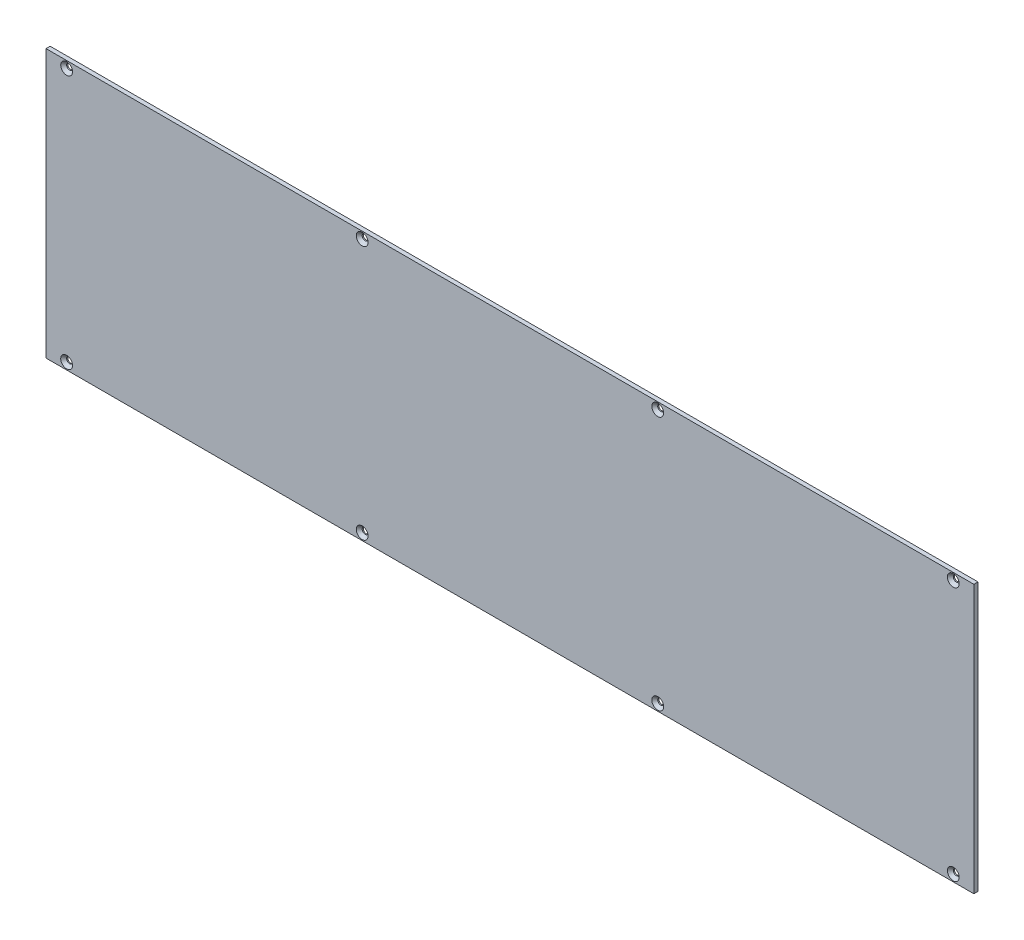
ISO-10303-21;
HEADER;
FILE_DESCRIPTION(('STEP AP214'),'2;1');
FILE_NAME('part.step','',(''),(''),'','','');
FILE_SCHEMA(('AUTOMOTIVE_DESIGN { 1 0 10303 214 1 1 1 1 }'));
ENDSEC;
DATA;
#1=APPLICATION_CONTEXT('core data for automotive mechanical design processes');
#2=APPLICATION_PROTOCOL_DEFINITION('international standard','automotive_design',2000,#1);
#3=PRODUCT_CONTEXT('',#1,'mechanical');
#4=PRODUCT('Part','Part','',(#3));
#5=PRODUCT_RELATED_PRODUCT_CATEGORY('part','',(#4));
#6=PRODUCT_DEFINITION_FORMATION('','',#4);
#7=PRODUCT_DEFINITION_CONTEXT('part definition',#1,'design');
#8=PRODUCT_DEFINITION('design','',#6,#7);
#9=PRODUCT_DEFINITION_SHAPE('','',#8);
#10=(LENGTH_UNIT() NAMED_UNIT(*) SI_UNIT(.MILLI.,.METRE.));
#11=(NAMED_UNIT(*) PLANE_ANGLE_UNIT() SI_UNIT($,.RADIAN.));
#12=(NAMED_UNIT(*) SI_UNIT($,.STERADIAN.) SOLID_ANGLE_UNIT());
#13=UNCERTAINTY_MEASURE_WITH_UNIT(LENGTH_MEASURE(1.E-05),#10,'distance_accuracy_value','');
#14=(GEOMETRIC_REPRESENTATION_CONTEXT(3) GLOBAL_UNCERTAINTY_ASSIGNED_CONTEXT((#13)) GLOBAL_UNIT_ASSIGNED_CONTEXT((#10,
#11,#12)) REPRESENTATION_CONTEXT('',''));
#15=CARTESIAN_POINT('',(0.,0.,0.));
#16=DIRECTION('',(0.,0.,1.));
#17=DIRECTION('',(1.,0.,0.));
#18=AXIS2_PLACEMENT_3D('',#15,#16,#17);
#19=CARTESIAN_POINT('',(4.16333634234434E-13,1.33226762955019E-12,2.99999999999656));
#20=DIRECTION('',(1.00000000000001,0.,0.));
#21=DIRECTION('',(0.,0.,-0.999999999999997));
#22=AXIS2_PLACEMENT_3D('',#19,#20,#21);
#23=PLANE('',#22);
#24=DIRECTION('',(0.,-1.,0.));
#25=VECTOR('',#24,1.);
#26=CARTESIAN_POINT('',(0.,0.,0.));
#27=LINE('',#26,#25);
#28=CARTESIAN_POINT('',(-8.04911692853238E-13,195.,-1.11022302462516E-12));
#29=VERTEX_POINT('',#28);
#30=CARTESIAN_POINT('',(0.,0.,0.));
#31=VERTEX_POINT('',#30);
#32=EDGE_CURVE('E100',#29,#31,#27,.T.);
#33=ORIENTED_EDGE('',*,*,#32,.T.);
#34=DIRECTION('',(0.,0.,-0.999999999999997));
#35=VECTOR('',#34,1.);
#36=CARTESIAN_POINT('',(4.16333634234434E-13,1.33226762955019E-12,2.99999999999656));
#37=LINE('',#36,#35);
#38=CARTESIAN_POINT('',(4.16333634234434E-13,1.33226762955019E-12,2.99999999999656));
#39=VERTEX_POINT('',#38);
#40=EDGE_CURVE('E11',#39,#31,#37,.T.);
#41=ORIENTED_EDGE('',*,*,#40,.F.);
#42=DIRECTION('',(0.,-1.,0.));
#43=VECTOR('',#42,1.);
#44=CARTESIAN_POINT('',(4.16333634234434E-13,1.33226762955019E-12,2.99999999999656));
#45=LINE('',#44,#43);
#46=CARTESIAN_POINT('',(8.88178419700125E-13,195.000000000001,2.99999999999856));
#47=VERTEX_POINT('',#46);
#48=EDGE_CURVE('E88',#47,#39,#45,.T.);
#49=ORIENTED_EDGE('',*,*,#48,.F.);
#50=DIRECTION('',(0.,0.,-0.999999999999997));
#51=VECTOR('',#50,1.);
#52=CARTESIAN_POINT('',(8.88178419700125E-13,195.000000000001,2.99999999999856));
#53=LINE('',#52,#51);
#54=EDGE_CURVE('E96',#47,#29,#53,.T.);
#55=ORIENTED_EDGE('',*,*,#54,.T.);
#56=EDGE_LOOP('',(#33,#41,#49,#55));
#57=FACE_BOUND('',#56,.T.);
#58=ADVANCED_FACE('F36',(#57),#23,.F.);
#59=CARTESIAN_POINT('',(4.16333634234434E-13,1.33226762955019E-12,2.99999999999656));
#60=DIRECTION('',(0.,1.,0.));
#61=DIRECTION('',(0.,0.,0.999999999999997));
#62=AXIS2_PLACEMENT_3D('',#59,#60,#61);
#63=PLANE('',#62);
#64=DIRECTION('',(1.00000000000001,0.,0.));
#65=VECTOR('',#64,1.);
#66=CARTESIAN_POINT('',(0.,0.,0.));
#67=LINE('',#66,#65);
#68=CARTESIAN_POINT('',(675.000000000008,1.55431223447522E-12,1.55431223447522E-12));
#69=VERTEX_POINT('',#68);
#70=EDGE_CURVE('E92',#31,#69,#67,.T.);
#71=ORIENTED_EDGE('',*,*,#70,.T.);
#72=DIRECTION('',(0.,0.,-0.999999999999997));
#73=VECTOR('',#72,1.);
#74=CARTESIAN_POINT('',(675.000000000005,2.66453525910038E-12,2.99999999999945));
#75=LINE('',#74,#73);
#76=CARTESIAN_POINT('',(675.000000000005,2.66453525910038E-12,2.99999999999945));
#77=VERTEX_POINT('',#76);
#78=EDGE_CURVE('E45',#77,#69,#75,.T.);
#79=ORIENTED_EDGE('',*,*,#78,.F.);
#80=DIRECTION('',(1.00000000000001,0.,0.));
#81=VECTOR('',#80,1.);
#82=CARTESIAN_POINT('',(4.16333634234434E-13,1.33226762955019E-12,2.99999999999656));
#83=LINE('',#82,#81);
#84=EDGE_CURVE('E83',#39,#77,#83,.T.);
#85=ORIENTED_EDGE('',*,*,#84,.F.);
#86=ORIENTED_EDGE('',*,*,#40,.T.);
#87=EDGE_LOOP('',(#71,#79,#85,#86));
#88=FACE_BOUND('',#87,.T.);
#89=ADVANCED_FACE('F91',(#88),#63,.F.);
#90=CARTESIAN_POINT('',(675.000000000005,2.66453525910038E-12,2.99999999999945));
#91=DIRECTION('',(-1.00000000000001,0.,0.));
#92=DIRECTION('',(0.,0.,0.999999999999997));
#93=AXIS2_PLACEMENT_3D('',#90,#91,#92);
#94=PLANE('',#93);
#95=DIRECTION('',(0.,1.,0.));
#96=VECTOR('',#95,1.);
#97=CARTESIAN_POINT('',(675.000000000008,1.55431223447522E-12,1.55431223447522E-12));
#98=LINE('',#97,#96);
#99=CARTESIAN_POINT('',(675.000000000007,195.000000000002,-1.11022302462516E-12));
#100=VERTEX_POINT('',#99);
#101=EDGE_CURVE('E70',#69,#100,#98,.T.);
#102=ORIENTED_EDGE('',*,*,#101,.T.);
#103=DIRECTION('',(0.,0.,-0.999999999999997));
#104=VECTOR('',#103,1.);
#105=CARTESIAN_POINT('',(675.000000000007,195.000000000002,2.99999999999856));
#106=LINE('',#105,#104);
#107=CARTESIAN_POINT('',(675.000000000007,195.000000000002,2.99999999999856));
#108=VERTEX_POINT('',#107);
#109=EDGE_CURVE('E93',#108,#100,#106,.T.);
#110=ORIENTED_EDGE('',*,*,#109,.F.);
#111=DIRECTION('',(0.,1.,0.));
#112=VECTOR('',#111,1.);
#113=CARTESIAN_POINT('',(675.000000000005,2.66453525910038E-12,2.99999999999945));
#114=LINE('',#113,#112);
#115=EDGE_CURVE('E86',#77,#108,#114,.T.);
#116=ORIENTED_EDGE('',*,*,#115,.F.);
#117=ORIENTED_EDGE('',*,*,#78,.T.);
#118=EDGE_LOOP('',(#102,#110,#116,#117));
#119=FACE_BOUND('',#118,.T.);
#120=ADVANCED_FACE('F94',(#119),#94,.F.);
#121=CARTESIAN_POINT('',(8.88178419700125E-13,195.000000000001,2.99999999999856));
#122=DIRECTION('',(0.,-1.,0.));
#123=DIRECTION('',(0.,0.,-0.999999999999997));
#124=AXIS2_PLACEMENT_3D('',#121,#122,#123);
#125=PLANE('',#124);
#126=DIRECTION('',(-1.00000000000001,0.,0.));
#127=VECTOR('',#126,1.);
#128=CARTESIAN_POINT('',(-8.04911692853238E-13,195.,-1.11022302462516E-12));
#129=LINE('',#128,#127);
#130=EDGE_CURVE('E76',#100,#29,#129,.T.);
#131=ORIENTED_EDGE('',*,*,#130,.T.);
#132=ORIENTED_EDGE('',*,*,#54,.F.);
#133=DIRECTION('',(-1.00000000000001,0.,0.));
#134=VECTOR('',#133,1.);
#135=CARTESIAN_POINT('',(8.88178419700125E-13,195.000000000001,2.99999999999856));
#136=LINE('',#135,#134);
#137=EDGE_CURVE('E53',#108,#47,#136,.T.);
#138=ORIENTED_EDGE('',*,*,#137,.F.);
#139=ORIENTED_EDGE('',*,*,#109,.T.);
#140=EDGE_LOOP('',(#131,#132,#138,#139));
#141=FACE_BOUND('',#140,.T.);
#142=ADVANCED_FACE('F108',(#141),#125,.F.);
#143=CARTESIAN_POINT('',(4.16333634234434E-13,1.33226762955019E-12,2.99999999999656));
#144=DIRECTION('',(0.,0.,-0.999999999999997));
#145=DIRECTION('',(-1.00000000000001,0.,0.));
#146=AXIS2_PLACEMENT_3D('',#143,#144,#145);
#147=PLANE('',#146);
#148=CARTESIAN_POINT('',(14.9999999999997,5.00000000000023,2.99999999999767));
#149=DIRECTION('',(0.,0.,0.999999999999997));
#150=DIRECTION('',(1.00000000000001,0.,0.));
#151=AXIS2_PLACEMENT_3D('',#148,#149,#150);
#152=CIRCLE('',#151,4.3);
#153=CARTESIAN_POINT('',(19.2999999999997,5.00000000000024,2.99999999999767));
#154=VERTEX_POINT('',#153);
#155=EDGE_CURVE('E123',#154,#154,#152,.T.);
#156=ORIENTED_EDGE('',*,*,#155,.F.);
#157=EDGE_LOOP('',(#156));
#158=FACE_BOUND('',#157,.T.);
#159=CARTESIAN_POINT('',(660.000000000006,190.000000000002,2.999999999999));
#160=DIRECTION('',(0.,0.,0.999999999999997));
#161=DIRECTION('',(1.00000000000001,0.,0.));
#162=AXIS2_PLACEMENT_3D('',#159,#160,#161);
#163=CIRCLE('',#162,4.29999999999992);
#164=CARTESIAN_POINT('',(664.300000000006,190.000000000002,2.999999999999));
#165=VERTEX_POINT('',#164);
#166=EDGE_CURVE('E120',#165,#165,#163,.T.);
#167=ORIENTED_EDGE('',*,*,#166,.F.);
#168=EDGE_LOOP('',(#167));
#169=FACE_BOUND('',#168,.T.);
#170=CARTESIAN_POINT('',(445.000000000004,190.000000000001,2.99999999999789));
#171=DIRECTION('',(0.,0.,0.999999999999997));
#172=DIRECTION('',(1.00000000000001,0.,0.));
#173=AXIS2_PLACEMENT_3D('',#170,#171,#172);
#174=CIRCLE('',#173,4.29999999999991);
#175=CARTESIAN_POINT('',(449.300000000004,190.000000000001,2.99999999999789));
#176=VERTEX_POINT('',#175);
#177=EDGE_CURVE('E117',#176,#176,#174,.T.);
#178=ORIENTED_EDGE('',*,*,#177,.F.);
#179=EDGE_LOOP('',(#178));
#180=FACE_BOUND('',#179,.T.);
#181=CARTESIAN_POINT('',(230.000000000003,190.000000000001,2.99999999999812));
#182=DIRECTION('',(0.,0.,0.999999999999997));
#183=DIRECTION('',(1.00000000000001,0.,0.));
#184=AXIS2_PLACEMENT_3D('',#181,#182,#183);
#185=CIRCLE('',#184,4.3);
#186=CARTESIAN_POINT('',(234.300000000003,190.000000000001,2.99999999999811));
#187=VERTEX_POINT('',#186);
#188=EDGE_CURVE('E116',#187,#187,#185,.T.);
#189=ORIENTED_EDGE('',*,*,#188,.F.);
#190=EDGE_LOOP('',(#189));
#191=FACE_BOUND('',#190,.T.);
#192=CARTESIAN_POINT('',(230.000000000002,5.00000000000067,2.99999999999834));
#193=DIRECTION('',(0.,0.,0.999999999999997));
#194=DIRECTION('',(1.00000000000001,0.,0.));
#195=AXIS2_PLACEMENT_3D('',#192,#193,#194);
#196=CIRCLE('',#195,4.3);
#197=CARTESIAN_POINT('',(234.300000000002,5.00000000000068,2.99999999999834));
#198=VERTEX_POINT('',#197);
#199=EDGE_CURVE('E126',#198,#198,#196,.T.);
#200=ORIENTED_EDGE('',*,*,#199,.F.);
#201=EDGE_LOOP('',(#200));
#202=FACE_BOUND('',#201,.T.);
#203=CARTESIAN_POINT('',(445.000000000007,5.00000000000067,3.00000000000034));
#204=DIRECTION('',(0.,0.,0.999999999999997));
#205=DIRECTION('',(1.00000000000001,0.,0.));
#206=AXIS2_PLACEMENT_3D('',#203,#204,#205);
#207=CIRCLE('',#206,4.29999999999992);
#208=CARTESIAN_POINT('',(449.300000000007,5.00000000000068,3.00000000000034));
#209=VERTEX_POINT('',#208);
#210=EDGE_CURVE('E132',#209,#209,#207,.T.);
#211=ORIENTED_EDGE('',*,*,#210,.F.);
#212=EDGE_LOOP('',(#211));
#213=FACE_BOUND('',#212,.T.);
#214=CARTESIAN_POINT('',(660.000000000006,5.00000000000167,2.99999999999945));
#215=DIRECTION('',(0.,0.,0.999999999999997));
#216=DIRECTION('',(1.00000000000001,0.,0.));
#217=AXIS2_PLACEMENT_3D('',#214,#215,#216);
#218=CIRCLE('',#217,4.29999999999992);
#219=CARTESIAN_POINT('',(664.300000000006,5.00000000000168,2.99999999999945));
#220=VERTEX_POINT('',#219);
#221=EDGE_CURVE('E129',#220,#220,#218,.T.);
#222=ORIENTED_EDGE('',*,*,#221,.F.);
#223=EDGE_LOOP('',(#222));
#224=FACE_BOUND('',#223,.T.);
#225=CARTESIAN_POINT('',(15.0000000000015,190.,2.99999999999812));
#226=DIRECTION('',(0.,0.,0.999999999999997));
#227=DIRECTION('',(1.00000000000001,0.,0.));
#228=AXIS2_PLACEMENT_3D('',#225,#226,#227);
#229=CIRCLE('',#228,4.3);
#230=CARTESIAN_POINT('',(19.3000000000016,190.,2.99999999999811));
#231=VERTEX_POINT('',#230);
#232=EDGE_CURVE('E103',#231,#231,#229,.T.);
#233=ORIENTED_EDGE('',*,*,#232,.F.);
#234=EDGE_LOOP('',(#233));
#235=FACE_BOUND('',#234,.T.);
#236=ORIENTED_EDGE('',*,*,#48,.T.);
#237=ORIENTED_EDGE('',*,*,#84,.T.);
#238=ORIENTED_EDGE('',*,*,#115,.T.);
#239=ORIENTED_EDGE('',*,*,#137,.T.);
#240=EDGE_LOOP('',(#236,#237,#238,#239));
#241=FACE_BOUND('',#240,.T.);
#242=ADVANCED_FACE('F84',(#158,#169,#180,#191,#202,#213,#224,#235,#241),#147,.F.);
#243=CARTESIAN_POINT('',(0.,0.,0.));
#244=DIRECTION('',(0.,0.,-0.999999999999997));
#245=DIRECTION('',(-1.00000000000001,0.,0.));
#246=AXIS2_PLACEMENT_3D('',#243,#244,#245);
#247=PLANE('',#246);
#248=CARTESIAN_POINT('',(14.9999999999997,4.99999999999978,-1.99840144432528E-12));
#249=DIRECTION('',(0.,0.,0.999999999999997));
#250=DIRECTION('',(1.00000000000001,0.,0.));
#251=AXIS2_PLACEMENT_3D('',#248,#249,#250);
#252=CIRCLE('',#251,2.15);
#253=CARTESIAN_POINT('',(17.1499999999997,4.99999999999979,-1.99875949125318E-12));
#254=VERTEX_POINT('',#253);
#255=EDGE_CURVE('E182',#254,#254,#252,.T.);
#256=ORIENTED_EDGE('',*,*,#255,.T.);
#257=EDGE_LOOP('',(#256));
#258=FACE_BOUND('',#257,.T.);
#259=CARTESIAN_POINT('',(230.000000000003,5.00000000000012,-3.10862446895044E-12));
#260=DIRECTION('',(0.,0.,0.999999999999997));
#261=DIRECTION('',(1.00000000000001,0.,0.));
#262=AXIS2_PLACEMENT_3D('',#259,#260,#261);
#263=CIRCLE('',#262,2.15000000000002);
#264=CARTESIAN_POINT('',(232.150000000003,5.00000000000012,-3.10898251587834E-12));
#265=VERTEX_POINT('',#264);
#266=EDGE_CURVE('E171',#265,#265,#263,.T.);
#267=ORIENTED_EDGE('',*,*,#266,.T.);
#268=EDGE_LOOP('',(#267));
#269=FACE_BOUND('',#268,.T.);
#270=CARTESIAN_POINT('',(445.000000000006,5.00000000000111,-6.66133814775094E-13));
#271=DIRECTION('',(0.,0.,0.999999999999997));
#272=DIRECTION('',(1.00000000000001,0.,0.));
#273=AXIS2_PLACEMENT_3D('',#270,#271,#272);
#274=CIRCLE('',#273,2.1499999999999);
#275=CARTESIAN_POINT('',(447.150000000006,5.00000000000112,-6.66491861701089E-13));
#276=VERTEX_POINT('',#275);
#277=EDGE_CURVE('E165',#276,#276,#274,.T.);
#278=ORIENTED_EDGE('',*,*,#277,.T.);
#279=EDGE_LOOP('',(#278));
#280=FACE_BOUND('',#279,.T.);
#281=CARTESIAN_POINT('',(660.000000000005,5.00000000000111,2.22044604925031E-13));
#282=DIRECTION('',(0.,0.,0.999999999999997));
#283=DIRECTION('',(1.00000000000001,0.,0.));
#284=AXIS2_PLACEMENT_3D('',#281,#282,#283);
#285=CIRCLE('',#284,2.14999999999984);
#286=CARTESIAN_POINT('',(662.150000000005,5.00000000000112,2.21686557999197E-13));
#287=VERTEX_POINT('',#286);
#288=EDGE_CURVE('E159',#287,#287,#285,.T.);
#289=ORIENTED_EDGE('',*,*,#288,.T.);
#290=EDGE_LOOP('',(#289));
#291=FACE_BOUND('',#290,.T.);
#292=CARTESIAN_POINT('',(660.000000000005,190.000000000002,-8.88178419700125E-13));
#293=DIRECTION('',(0.,0.,0.999999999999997));
#294=DIRECTION('',(1.00000000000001,0.,0.));
#295=AXIS2_PLACEMENT_3D('',#292,#293,#294);
#296=CIRCLE('',#295,2.14999999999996);
#297=CARTESIAN_POINT('',(662.150000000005,190.000000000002,-8.88536466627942E-13));
#298=VERTEX_POINT('',#297);
#299=EDGE_CURVE('E153',#298,#298,#296,.T.);
#300=ORIENTED_EDGE('',*,*,#299,.T.);
#301=EDGE_LOOP('',(#300));
#302=FACE_BOUND('',#301,.T.);
#303=CARTESIAN_POINT('',(445.000000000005,190.000000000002,-1.55431223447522E-12));
#304=DIRECTION('',(0.,0.,0.999999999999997));
#305=DIRECTION('',(1.00000000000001,0.,0.));
#306=AXIS2_PLACEMENT_3D('',#303,#304,#305);
#307=CIRCLE('',#306,2.14999999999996);
#308=CARTESIAN_POINT('',(447.150000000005,190.000000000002,-1.55467028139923E-12));
#309=VERTEX_POINT('',#308);
#310=EDGE_CURVE('E147',#309,#309,#307,.T.);
#311=ORIENTED_EDGE('',*,*,#310,.T.);
#312=EDGE_LOOP('',(#311));
#313=FACE_BOUND('',#312,.T.);
#314=CARTESIAN_POINT('',(230.000000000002,190.000000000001,-1.55431223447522E-12));
#315=DIRECTION('',(0.,0.,0.999999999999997));
#316=DIRECTION('',(1.00000000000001,0.,0.));
#317=AXIS2_PLACEMENT_3D('',#314,#315,#316);
#318=CIRCLE('',#317,2.14999999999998);
#319=CARTESIAN_POINT('',(232.150000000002,190.000000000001,-1.55467028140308E-12));
#320=VERTEX_POINT('',#319);
#321=EDGE_CURVE('E141',#320,#320,#318,.T.);
#322=ORIENTED_EDGE('',*,*,#321,.T.);
#323=EDGE_LOOP('',(#322));
#324=FACE_BOUND('',#323,.T.);
#325=CARTESIAN_POINT('',(15.0000000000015,190.000000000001,-1.11022302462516E-12));
#326=DIRECTION('',(0.,0.,0.999999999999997));
#327=DIRECTION('',(1.00000000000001,0.,0.));
#328=AXIS2_PLACEMENT_3D('',#325,#326,#327);
#329=CIRCLE('',#328,2.14999999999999);
#330=CARTESIAN_POINT('',(17.1500000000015,190.000000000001,-1.11058107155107E-12));
#331=VERTEX_POINT('',#330);
#332=EDGE_CURVE('E133',#331,#331,#329,.T.);
#333=ORIENTED_EDGE('',*,*,#332,.T.);
#334=EDGE_LOOP('',(#333));
#335=FACE_BOUND('',#334,.T.);
#336=ORIENTED_EDGE('',*,*,#32,.F.);
#337=ORIENTED_EDGE('',*,*,#130,.F.);
#338=ORIENTED_EDGE('',*,*,#101,.F.);
#339=ORIENTED_EDGE('',*,*,#70,.F.);
#340=EDGE_LOOP('',(#336,#337,#338,#339));
#341=FACE_BOUND('',#340,.T.);
#342=ADVANCED_FACE('F111',(#258,#269,#280,#291,#302,#313,#324,#335,#341),#247,.T.);
#343=CARTESIAN_POINT('',(15.0000000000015,190.,2.99999999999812));
#344=DIRECTION('',(0.,0.,0.999999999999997));
#345=DIRECTION('',(1.00000000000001,0.,0.));
#346=AXIS2_PLACEMENT_3D('',#343,#344,#345);
#347=CONICAL_SURFACE('',#346,4.3,0.78539816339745);
#348=CARTESIAN_POINT('',(15.0000000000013,190.,0.849999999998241));
#349=DIRECTION('',(0.,0.,0.999999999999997));
#350=DIRECTION('',(1.00000000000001,0.,0.));
#351=AXIS2_PLACEMENT_3D('',#348,#349,#350);
#352=CIRCLE('',#351,2.14999999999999);
#353=CARTESIAN_POINT('',(17.1500000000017,190.,0.849999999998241));
#354=VERTEX_POINT('',#353);
#355=EDGE_CURVE('E138',#354,#354,#352,.T.);
#356=CARTESIAN_POINT('',(17.1500000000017,190.,0.849999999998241));
#357=CARTESIAN_POINT('',(17.172395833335,190.,0.872395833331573));
#358=CARTESIAN_POINT('',(17.1947916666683,190.,0.894791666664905));
#359=CARTESIAN_POINT('',(17.239583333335,190.,0.939583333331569));
#360=CARTESIAN_POINT('',(17.2619791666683,190.,0.961979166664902));
#361=CARTESIAN_POINT('',(17.306770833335,190.,1.00677083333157));
#362=CARTESIAN_POINT('',(17.3291666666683,190.,1.0291666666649));
#363=CARTESIAN_POINT('',(17.373958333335,190.,1.07395833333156));
#364=CARTESIAN_POINT('',(17.3963541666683,190.,1.09635416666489));
#365=CARTESIAN_POINT('',(17.441145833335,190.,1.14114583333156));
#366=CARTESIAN_POINT('',(17.4635416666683,190.,1.16354166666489));
#367=CARTESIAN_POINT('',(17.508333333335,190.,1.20833333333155));
#368=CARTESIAN_POINT('',(17.5307291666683,190.,1.23072916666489));
#369=CARTESIAN_POINT('',(17.575520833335,190.,1.27552083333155));
#370=CARTESIAN_POINT('',(17.5979166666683,190.,1.29791666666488));
#371=CARTESIAN_POINT('',(17.642708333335,190.,1.34270833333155));
#372=CARTESIAN_POINT('',(17.6651041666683,190.,1.36510416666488));
#373=CARTESIAN_POINT('',(17.709895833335,190.,1.40989583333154));
#374=CARTESIAN_POINT('',(17.7322916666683,190.,1.43229166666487));
#375=CARTESIAN_POINT('',(17.777083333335,190.,1.47708333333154));
#376=CARTESIAN_POINT('',(17.7994791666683,190.,1.49947916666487));
#377=CARTESIAN_POINT('',(17.844270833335,190.,1.54427083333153));
#378=CARTESIAN_POINT('',(17.8666666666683,190.,1.56666666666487));
#379=CARTESIAN_POINT('',(17.911458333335,190.,1.61145833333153));
#380=CARTESIAN_POINT('',(17.9338541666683,190.,1.63385416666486));
#381=CARTESIAN_POINT('',(17.978645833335,190.,1.67864583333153));
#382=CARTESIAN_POINT('',(18.0010416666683,190.,1.70104166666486));
#383=CARTESIAN_POINT('',(18.045833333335,190.,1.74583333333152));
#384=CARTESIAN_POINT('',(18.0682291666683,190.,1.76822916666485));
#385=CARTESIAN_POINT('',(18.113020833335,190.,1.81302083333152));
#386=CARTESIAN_POINT('',(18.1354166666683,190.,1.83541666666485));
#387=CARTESIAN_POINT('',(18.1802083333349,190.,1.88020833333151));
#388=CARTESIAN_POINT('',(18.2026041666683,190.,1.90260416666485));
#389=CARTESIAN_POINT('',(18.2473958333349,190.,1.94739583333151));
#390=CARTESIAN_POINT('',(18.2697916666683,190.,1.96979166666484));
#391=CARTESIAN_POINT('',(18.3145833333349,190.,2.01458333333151));
#392=CARTESIAN_POINT('',(18.3369791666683,190.,2.03697916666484));
#393=CARTESIAN_POINT('',(18.3817708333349,190.,2.0817708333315));
#394=CARTESIAN_POINT('',(18.4041666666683,190.,2.10416666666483));
#395=CARTESIAN_POINT('',(18.4489583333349,190.,2.1489583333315));
#396=CARTESIAN_POINT('',(18.4713541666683,190.,2.17135416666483));
#397=CARTESIAN_POINT('',(18.5161458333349,190.,2.21614583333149));
#398=CARTESIAN_POINT('',(18.5385416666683,190.,2.23854166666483));
#399=CARTESIAN_POINT('',(18.5833333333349,190.,2.28333333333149));
#400=CARTESIAN_POINT('',(18.6057291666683,190.,2.30572916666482));
#401=CARTESIAN_POINT('',(18.6505208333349,190.,2.35052083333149));
#402=CARTESIAN_POINT('',(18.6729166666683,190.,2.37291666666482));
#403=CARTESIAN_POINT('',(18.7177083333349,190.,2.41770833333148));
#404=CARTESIAN_POINT('',(18.7401041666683,190.,2.44010416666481));
#405=CARTESIAN_POINT('',(18.7848958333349,190.,2.48489583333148));
#406=CARTESIAN_POINT('',(18.8072916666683,190.,2.50729166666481));
#407=CARTESIAN_POINT('',(18.8520833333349,190.,2.55208333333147));
#408=CARTESIAN_POINT('',(18.8744791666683,190.,2.57447916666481));
#409=CARTESIAN_POINT('',(18.9192708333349,190.,2.61927083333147));
#410=CARTESIAN_POINT('',(18.9416666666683,190.,2.6416666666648));
#411=CARTESIAN_POINT('',(18.9864583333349,190.,2.68645833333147));
#412=CARTESIAN_POINT('',(19.0088541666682,190.,2.7088541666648));
#413=CARTESIAN_POINT('',(19.0536458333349,190.,2.75364583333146));
#414=CARTESIAN_POINT('',(19.0760416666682,190.,2.77604166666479));
#415=CARTESIAN_POINT('',(19.1208333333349,190.,2.82083333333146));
#416=CARTESIAN_POINT('',(19.1432291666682,190.,2.84322916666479));
#417=CARTESIAN_POINT('',(19.1880208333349,190.,2.88802083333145));
#418=CARTESIAN_POINT('',(19.2104166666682,190.,2.91041666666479));
#419=CARTESIAN_POINT('',(19.2552083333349,190.,2.95520833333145));
#420=CARTESIAN_POINT('',(19.2776041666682,190.,2.97760416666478));
#421=CARTESIAN_POINT('',(19.3000000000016,190.,2.99999999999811));
#422=B_SPLINE_CURVE_WITH_KNOTS('',3,(#356,#357,#358,#359,#360,#361,#362,#363,#364,#365,#366,
#367,#368,#369,#370,#371,#372,#373,#374,#375,#376,#377,#378,#379,#380,#381,#382,#383,#384,#385,
#386,#387,#388,#389,#390,#391,#392,#393,#394,#395,#396,#397,#398,#399,#400,#401,#402,#403,#404,
#405,#406,#407,#408,#409,#410,#411,#412,#413,#414,#415,#416,#417,#418,#419,#420,#421),
.UNSPECIFIED.,.F.,.F.,(4,2,2,2,2,2,2,2,2,2,2,2,2,2,2,2,2,2,2,2,2,2,2,2,2,2,2,2,2,2,2,2,4),(0.,
0.0950174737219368,0.190034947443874,0.285052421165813,0.380069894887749,0.475087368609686,
0.570104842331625,0.665122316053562,0.760139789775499,0.855157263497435,0.950174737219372,
1.04519221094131,1.14020968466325,1.23522715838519,1.33024463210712,1.42526210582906,
1.520279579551,1.61529705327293,1.71031452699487,1.80533200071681,1.90034947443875,
1.99536694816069,2.09038442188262,2.18540189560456,2.2804193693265,2.37543684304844,
2.47045431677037,2.56547179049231,2.66048926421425,2.75550673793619,2.85052421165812,
2.94554168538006,3.040559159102),.UNSPECIFIED.);
#423=EDGE_CURVE('BSEAM38',#354,#231,#422,.T.);
#424=ORIENTED_EDGE('',*,*,#355,.F.);
#425=ORIENTED_EDGE('',*,*,#232,.T.);
#426=ORIENTED_EDGE('',*,*,#423,.T.);
#427=ORIENTED_EDGE('',*,*,#423,.F.);
#428=EDGE_LOOP('',(#424,#426,#425,#427));
#429=FACE_BOUND('',#428,.T.);
#430=ADVANCED_FACE('F38',(#429),#347,.F.);
#431=CARTESIAN_POINT('',(660.000000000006,5.00000000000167,2.99999999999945));
#432=DIRECTION('',(0.,0.,0.999999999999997));
#433=DIRECTION('',(1.00000000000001,0.,0.));
#434=AXIS2_PLACEMENT_3D('',#431,#432,#433);
#435=CONICAL_SURFACE('',#434,4.29999999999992,0.78539816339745);
#436=CARTESIAN_POINT('',(660.000000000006,5.00000000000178,0.849999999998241));
#437=DIRECTION('',(0.,0.,0.999999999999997));
#438=DIRECTION('',(1.00000000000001,0.,0.));
#439=AXIS2_PLACEMENT_3D('',#436,#437,#438);
#440=CIRCLE('',#439,2.14999999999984);
#441=CARTESIAN_POINT('',(662.150000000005,5.00000000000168,0.849999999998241));
#442=VERTEX_POINT('',#441);
#443=EDGE_CURVE('E162',#442,#442,#440,.T.);
#444=CARTESIAN_POINT('',(662.150000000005,5.00000000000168,0.849999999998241));
#445=CARTESIAN_POINT('',(662.172395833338,5.00000000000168,0.87239583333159));
#446=CARTESIAN_POINT('',(662.194791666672,5.00000000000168,0.894791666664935));
#447=CARTESIAN_POINT('',(662.239583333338,5.00000000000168,0.939583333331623));
#448=CARTESIAN_POINT('',(662.261979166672,5.00000000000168,0.961979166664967));
#449=CARTESIAN_POINT('',(662.306770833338,5.00000000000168,1.00677083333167));
#450=CARTESIAN_POINT('',(662.329166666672,5.00000000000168,1.02916666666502));
#451=CARTESIAN_POINT('',(662.373958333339,5.00000000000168,1.07395833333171));
#452=CARTESIAN_POINT('',(662.396354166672,5.00000000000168,1.09635416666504));
#453=CARTESIAN_POINT('',(662.441145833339,5.00000000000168,1.14114583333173));
#454=CARTESIAN_POINT('',(662.463541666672,5.00000000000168,1.16354166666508));
#455=CARTESIAN_POINT('',(662.508333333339,5.00000000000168,1.20833333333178));
#456=CARTESIAN_POINT('',(662.530729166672,5.00000000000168,1.23072916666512));
#457=CARTESIAN_POINT('',(662.575520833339,5.00000000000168,1.27552083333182));
#458=CARTESIAN_POINT('',(662.597916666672,5.00000000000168,1.29791666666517));
#459=CARTESIAN_POINT('',(662.642708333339,5.00000000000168,1.34270833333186));
#460=CARTESIAN_POINT('',(662.665104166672,5.00000000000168,1.36510416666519));
#461=CARTESIAN_POINT('',(662.709895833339,5.00000000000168,1.40989583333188));
#462=CARTESIAN_POINT('',(662.732291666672,5.00000000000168,1.43229166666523));
#463=CARTESIAN_POINT('',(662.777083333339,5.00000000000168,1.47708333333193));
#464=CARTESIAN_POINT('',(662.799479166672,5.00000000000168,1.49947916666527));
#465=CARTESIAN_POINT('',(662.844270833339,5.00000000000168,1.54427083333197));
#466=CARTESIAN_POINT('',(662.866666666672,5.00000000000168,1.56666666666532));
#467=CARTESIAN_POINT('',(662.911458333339,5.00000000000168,1.61145833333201));
#468=CARTESIAN_POINT('',(662.933854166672,5.00000000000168,1.63385416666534));
#469=CARTESIAN_POINT('',(662.978645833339,5.00000000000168,1.67864583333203));
#470=CARTESIAN_POINT('',(663.001041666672,5.00000000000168,1.70104166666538));
#471=CARTESIAN_POINT('',(663.045833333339,5.00000000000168,1.74583333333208));
#472=CARTESIAN_POINT('',(663.068229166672,5.00000000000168,1.76822916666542));
#473=CARTESIAN_POINT('',(663.113020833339,5.00000000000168,1.81302083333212));
#474=CARTESIAN_POINT('',(663.135416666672,5.00000000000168,1.83541666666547));
#475=CARTESIAN_POINT('',(663.180208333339,5.00000000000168,1.88020833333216));
#476=CARTESIAN_POINT('',(663.202604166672,5.00000000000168,1.90260416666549));
#477=CARTESIAN_POINT('',(663.247395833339,5.00000000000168,1.94739583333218));
#478=CARTESIAN_POINT('',(663.269791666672,5.00000000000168,1.96979166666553));
#479=CARTESIAN_POINT('',(663.314583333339,5.00000000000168,2.01458333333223));
#480=CARTESIAN_POINT('',(663.336979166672,5.00000000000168,2.03697916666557));
#481=CARTESIAN_POINT('',(663.381770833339,5.00000000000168,2.08177083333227));
#482=CARTESIAN_POINT('',(663.404166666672,5.00000000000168,2.10416666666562));
#483=CARTESIAN_POINT('',(663.448958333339,5.00000000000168,2.14895833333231));
#484=CARTESIAN_POINT('',(663.471354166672,5.00000000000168,2.17135416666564));
#485=CARTESIAN_POINT('',(663.516145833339,5.00000000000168,2.21614583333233));
#486=CARTESIAN_POINT('',(663.538541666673,5.00000000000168,2.23854166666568));
#487=CARTESIAN_POINT('',(663.583333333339,5.00000000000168,2.28333333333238));
#488=CARTESIAN_POINT('',(663.605729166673,5.00000000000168,2.30572916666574));
#489=CARTESIAN_POINT('',(663.650520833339,5.00000000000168,2.35052083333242));
#490=CARTESIAN_POINT('',(663.672916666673,5.00000000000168,2.37291666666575));
#491=CARTESIAN_POINT('',(663.717708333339,5.00000000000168,2.41770833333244));
#492=CARTESIAN_POINT('',(663.740104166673,5.00000000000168,2.4401041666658));
#493=CARTESIAN_POINT('',(663.784895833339,5.00000000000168,2.48489583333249));
#494=CARTESIAN_POINT('',(663.807291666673,5.00000000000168,2.50729166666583));
#495=CARTESIAN_POINT('',(663.852083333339,5.00000000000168,2.55208333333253));
#496=CARTESIAN_POINT('',(663.874479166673,5.00000000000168,2.57447916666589));
#497=CARTESIAN_POINT('',(663.91927083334,5.00000000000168,2.61927083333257));
#498=CARTESIAN_POINT('',(663.941666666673,5.00000000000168,2.6416666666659));
#499=CARTESIAN_POINT('',(663.986458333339,5.00000000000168,2.68645833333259));
#500=CARTESIAN_POINT('',(664.008854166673,5.00000000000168,2.70885416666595));
#501=CARTESIAN_POINT('',(664.053645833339,5.00000000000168,2.75364583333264));
#502=CARTESIAN_POINT('',(664.076041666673,5.00000000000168,2.77604166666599));
#503=CARTESIAN_POINT('',(664.12083333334,5.00000000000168,2.82083333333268));
#504=CARTESIAN_POINT('',(664.143229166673,5.00000000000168,2.84322916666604));
#505=CARTESIAN_POINT('',(664.18802083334,5.00000000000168,2.88802083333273));
#506=CARTESIAN_POINT('',(664.210416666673,5.00000000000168,2.91041666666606));
#507=CARTESIAN_POINT('',(664.25520833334,5.00000000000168,2.95520833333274));
#508=CARTESIAN_POINT('',(664.277604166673,5.00000000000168,2.97760416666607));
#509=CARTESIAN_POINT('',(664.300000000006,5.00000000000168,2.99999999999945));
#510=B_SPLINE_CURVE_WITH_KNOTS('',3,(#444,#445,#446,#447,#448,#449,#450,#451,#452,#453,#454,
#455,#456,#457,#458,#459,#460,#461,#462,#463,#464,#465,#466,#467,#468,#469,#470,#471,#472,#473,
#474,#475,#476,#477,#478,#479,#480,#481,#482,#483,#484,#485,#486,#487,#488,#489,#490,#491,#492,
#493,#494,#495,#496,#497,#498,#499,#500,#501,#502,#503,#504,#505,#506,#507,#508,#509),
.UNSPECIFIED.,.F.,.F.,(4,2,2,2,2,2,2,2,2,2,2,2,2,2,2,2,2,2,2,2,2,2,2,2,2,2,2,2,2,2,2,2,4),(0.,
0.095017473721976,0.190034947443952,0.285052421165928,0.380069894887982,0.475087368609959,
0.570104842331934,0.665122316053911,0.760139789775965,0.855157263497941,0.950174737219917,
1.04519221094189,1.14020968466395,1.23522715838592,1.3302446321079,1.42526210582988,
1.52027957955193,1.61529705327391,1.71031452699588,1.80533200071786,1.90034947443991,
1.99536694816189,2.09038442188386,2.18540189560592,2.2804193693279,2.37543684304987,
2.47045431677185,2.5654717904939,2.66048926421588,2.75550673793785,2.85052421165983,
2.94554168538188,3.04055915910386),.UNSPECIFIED.);
#511=EDGE_CURVE('BSEAM221',#442,#220,#510,.T.);
#512=ORIENTED_EDGE('',*,*,#443,.F.);
#513=ORIENTED_EDGE('',*,*,#221,.T.);
#514=ORIENTED_EDGE('',*,*,#511,.T.);
#515=ORIENTED_EDGE('',*,*,#511,.F.);
#516=EDGE_LOOP('',(#512,#514,#513,#515));
#517=FACE_BOUND('',#516,.T.);
#518=ADVANCED_FACE('F221',(#517),#435,.F.);
#519=CARTESIAN_POINT('',(445.000000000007,5.00000000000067,3.00000000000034));
#520=DIRECTION('',(0.,0.,0.999999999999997));
#521=DIRECTION('',(1.00000000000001,0.,0.));
#522=AXIS2_PLACEMENT_3D('',#519,#520,#521);
#523=CONICAL_SURFACE('',#522,4.29999999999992,0.78539816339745);
#524=CARTESIAN_POINT('',(445.000000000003,5.00000000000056,0.850000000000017));
#525=DIRECTION('',(0.,0.,0.999999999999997));
#526=DIRECTION('',(1.00000000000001,0.,0.));
#527=AXIS2_PLACEMENT_3D('',#524,#525,#526);
#528=CIRCLE('',#527,2.1499999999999);
#529=CARTESIAN_POINT('',(447.150000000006,5.00000000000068,0.850000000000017));
#530=VERTEX_POINT('',#529);
#531=EDGE_CURVE('E168',#530,#530,#528,.T.);
#532=CARTESIAN_POINT('',(447.150000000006,5.00000000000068,0.850000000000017));
#533=CARTESIAN_POINT('',(447.17239583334,5.00000000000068,0.872395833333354));
#534=CARTESIAN_POINT('',(447.194791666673,5.00000000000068,0.894791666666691));
#535=CARTESIAN_POINT('',(447.23958333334,5.00000000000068,0.939583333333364));
#536=CARTESIAN_POINT('',(447.261979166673,5.00000000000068,0.961979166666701));
#537=CARTESIAN_POINT('',(447.30677083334,5.00000000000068,1.00677083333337));
#538=CARTESIAN_POINT('',(447.329166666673,5.00000000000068,1.02916666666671));
#539=CARTESIAN_POINT('',(447.37395833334,5.00000000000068,1.07395833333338));
#540=CARTESIAN_POINT('',(447.396354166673,5.00000000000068,1.09635416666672));
#541=CARTESIAN_POINT('',(447.44114583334,5.00000000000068,1.14114583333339));
#542=CARTESIAN_POINT('',(447.463541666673,5.00000000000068,1.16354166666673));
#543=CARTESIAN_POINT('',(447.50833333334,5.00000000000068,1.2083333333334));
#544=CARTESIAN_POINT('',(447.530729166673,5.00000000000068,1.23072916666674));
#545=CARTESIAN_POINT('',(447.57552083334,5.00000000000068,1.27552083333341));
#546=CARTESIAN_POINT('',(447.597916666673,5.00000000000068,1.29791666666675));
#547=CARTESIAN_POINT('',(447.64270833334,5.00000000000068,1.34270833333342));
#548=CARTESIAN_POINT('',(447.665104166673,5.00000000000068,1.36510416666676));
#549=CARTESIAN_POINT('',(447.70989583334,5.00000000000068,1.40989583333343));
#550=CARTESIAN_POINT('',(447.732291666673,5.00000000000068,1.43229166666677));
#551=CARTESIAN_POINT('',(447.77708333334,5.00000000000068,1.47708333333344));
#552=CARTESIAN_POINT('',(447.799479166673,5.00000000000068,1.49947916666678));
#553=CARTESIAN_POINT('',(447.84427083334,5.00000000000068,1.54427083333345));
#554=CARTESIAN_POINT('',(447.866666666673,5.00000000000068,1.56666666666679));
#555=CARTESIAN_POINT('',(447.91145833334,5.00000000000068,1.61145833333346));
#556=CARTESIAN_POINT('',(447.933854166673,5.00000000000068,1.6338541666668));
#557=CARTESIAN_POINT('',(447.97864583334,5.00000000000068,1.67864583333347));
#558=CARTESIAN_POINT('',(448.001041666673,5.00000000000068,1.70104166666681));
#559=CARTESIAN_POINT('',(448.04583333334,5.00000000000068,1.74583333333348));
#560=CARTESIAN_POINT('',(448.068229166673,5.00000000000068,1.76822916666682));
#561=CARTESIAN_POINT('',(448.11302083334,5.00000000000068,1.81302083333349));
#562=CARTESIAN_POINT('',(448.135416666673,5.00000000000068,1.83541666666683));
#563=CARTESIAN_POINT('',(448.18020833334,5.00000000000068,1.8802083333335));
#564=CARTESIAN_POINT('',(448.202604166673,5.00000000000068,1.90260416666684));
#565=CARTESIAN_POINT('',(448.24739583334,5.00000000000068,1.94739583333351));
#566=CARTESIAN_POINT('',(448.269791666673,5.00000000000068,1.96979166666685));
#567=CARTESIAN_POINT('',(448.31458333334,5.00000000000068,2.01458333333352));
#568=CARTESIAN_POINT('',(448.336979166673,5.00000000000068,2.03697916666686));
#569=CARTESIAN_POINT('',(448.38177083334,5.00000000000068,2.08177083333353));
#570=CARTESIAN_POINT('',(448.404166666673,5.00000000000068,2.10416666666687));
#571=CARTESIAN_POINT('',(448.44895833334,5.00000000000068,2.14895833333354));
#572=CARTESIAN_POINT('',(448.471354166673,5.00000000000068,2.17135416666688));
#573=CARTESIAN_POINT('',(448.51614583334,5.00000000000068,2.21614583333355));
#574=CARTESIAN_POINT('',(448.538541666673,5.00000000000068,2.23854166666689));
#575=CARTESIAN_POINT('',(448.58333333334,5.00000000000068,2.28333333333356));
#576=CARTESIAN_POINT('',(448.605729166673,5.00000000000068,2.3057291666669));
#577=CARTESIAN_POINT('',(448.65052083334,5.00000000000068,2.35052083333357));
#578=CARTESIAN_POINT('',(448.672916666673,5.00000000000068,2.37291666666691));
#579=CARTESIAN_POINT('',(448.71770833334,5.00000000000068,2.41770833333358));
#580=CARTESIAN_POINT('',(448.740104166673,5.00000000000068,2.44010416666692));
#581=CARTESIAN_POINT('',(448.78489583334,5.00000000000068,2.48489583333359));
#582=CARTESIAN_POINT('',(448.807291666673,5.00000000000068,2.50729166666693));
#583=CARTESIAN_POINT('',(448.85208333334,5.00000000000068,2.55208333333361));
#584=CARTESIAN_POINT('',(448.874479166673,5.00000000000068,2.57447916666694));
#585=CARTESIAN_POINT('',(448.91927083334,5.00000000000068,2.61927083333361));
#586=CARTESIAN_POINT('',(448.941666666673,5.00000000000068,2.64166666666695));
#587=CARTESIAN_POINT('',(448.98645833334,5.00000000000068,2.68645833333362));
#588=CARTESIAN_POINT('',(449.008854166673,5.00000000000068,2.70885416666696));
#589=CARTESIAN_POINT('',(449.05364583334,5.00000000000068,2.75364583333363));
#590=CARTESIAN_POINT('',(449.076041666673,5.00000000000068,2.77604166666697));
#591=CARTESIAN_POINT('',(449.12083333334,5.00000000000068,2.82083333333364));
#592=CARTESIAN_POINT('',(449.143229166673,5.00000000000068,2.84322916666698));
#593=CARTESIAN_POINT('',(449.18802083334,5.00000000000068,2.88802083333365));
#594=CARTESIAN_POINT('',(449.210416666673,5.00000000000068,2.91041666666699));
#595=CARTESIAN_POINT('',(449.25520833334,5.00000000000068,2.95520833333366));
#596=CARTESIAN_POINT('',(449.277604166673,5.00000000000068,2.977604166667));
#597=CARTESIAN_POINT('',(449.300000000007,5.00000000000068,3.00000000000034));
#598=B_SPLINE_CURVE_WITH_KNOTS('',3,(#532,#533,#534,#535,#536,#537,#538,#539,#540,#541,#542,
#543,#544,#545,#546,#547,#548,#549,#550,#551,#552,#553,#554,#555,#556,#557,#558,#559,#560,#561,
#562,#563,#564,#565,#566,#567,#568,#569,#570,#571,#572,#573,#574,#575,#576,#577,#578,#579,#580,
#581,#582,#583,#584,#585,#586,#587,#588,#589,#590,#591,#592,#593,#594,#595,#596,#597),
.UNSPECIFIED.,.F.,.F.,(4,2,2,2,2,2,2,2,2,2,2,2,2,2,2,2,2,2,2,2,2,2,2,2,2,2,2,2,2,2,2,2,4),(0.,
0.0950174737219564,0.190034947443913,0.285052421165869,0.380069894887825,0.475087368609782,
0.570104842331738,0.665122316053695,0.760139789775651,0.855157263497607,0.950174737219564,
1.04519221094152,1.14020968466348,1.23522715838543,1.33024463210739,1.42526210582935,
1.5202795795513,1.61529705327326,1.71031452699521,1.80533200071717,1.90034947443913,
1.99536694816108,2.09038442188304,2.185401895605,2.28041936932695,2.37543684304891,
2.47045431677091,2.56547179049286,2.66048926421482,2.75550673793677,2.85052421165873,
2.94554168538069,3.04055915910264),.UNSPECIFIED.);
#599=EDGE_CURVE('BSEAM217',#530,#209,#598,.T.);
#600=ORIENTED_EDGE('',*,*,#531,.F.);
#601=ORIENTED_EDGE('',*,*,#210,.T.);
#602=ORIENTED_EDGE('',*,*,#599,.T.);
#603=ORIENTED_EDGE('',*,*,#599,.F.);
#604=EDGE_LOOP('',(#600,#602,#601,#603));
#605=FACE_BOUND('',#604,.T.);
#606=ADVANCED_FACE('F217',(#605),#523,.F.);
#607=CARTESIAN_POINT('',(230.000000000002,5.00000000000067,2.99999999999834));
#608=DIRECTION('',(0.,0.,0.999999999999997));
#609=DIRECTION('',(1.00000000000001,0.,0.));
#610=AXIS2_PLACEMENT_3D('',#607,#608,#609);
#611=CONICAL_SURFACE('',#610,4.3,0.78539816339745);
#612=CARTESIAN_POINT('',(230.000000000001,5.00000000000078,0.849999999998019));
#613=DIRECTION('',(0.,0.,0.999999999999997));
#614=DIRECTION('',(1.00000000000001,0.,0.));
#615=AXIS2_PLACEMENT_3D('',#612,#613,#614);
#616=CIRCLE('',#615,2.15000000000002);
#617=CARTESIAN_POINT('',(232.150000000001,5.00000000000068,0.849999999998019));
#618=VERTEX_POINT('',#617);
#619=EDGE_CURVE('E174',#618,#618,#616,.T.);
#620=CARTESIAN_POINT('',(232.150000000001,5.00000000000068,0.849999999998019));
#621=CARTESIAN_POINT('',(232.172395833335,5.00000000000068,0.872395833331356));
#622=CARTESIAN_POINT('',(232.194791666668,5.00000000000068,0.894791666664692));
#623=CARTESIAN_POINT('',(232.239583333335,5.00000000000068,0.939583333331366));
#624=CARTESIAN_POINT('',(232.261979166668,5.00000000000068,0.961979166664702));
#625=CARTESIAN_POINT('',(232.306770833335,5.00000000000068,1.00677083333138));
#626=CARTESIAN_POINT('',(232.329166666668,5.00000000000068,1.02916666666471));
#627=CARTESIAN_POINT('',(232.373958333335,5.00000000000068,1.07395833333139));
#628=CARTESIAN_POINT('',(232.396354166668,5.00000000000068,1.09635416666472));
#629=CARTESIAN_POINT('',(232.441145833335,5.00000000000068,1.1411458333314));
#630=CARTESIAN_POINT('',(232.463541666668,5.00000000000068,1.16354166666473));
#631=CARTESIAN_POINT('',(232.508333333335,5.00000000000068,1.20833333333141));
#632=CARTESIAN_POINT('',(232.530729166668,5.00000000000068,1.23072916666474));
#633=CARTESIAN_POINT('',(232.575520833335,5.00000000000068,1.27552083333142));
#634=CARTESIAN_POINT('',(232.597916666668,5.00000000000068,1.29791666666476));
#635=CARTESIAN_POINT('',(232.642708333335,5.00000000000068,1.34270833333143));
#636=CARTESIAN_POINT('',(232.665104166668,5.00000000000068,1.36510416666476));
#637=CARTESIAN_POINT('',(232.709895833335,5.00000000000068,1.40989583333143));
#638=CARTESIAN_POINT('',(232.732291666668,5.00000000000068,1.43229166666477));
#639=CARTESIAN_POINT('',(232.777083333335,5.00000000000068,1.47708333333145));
#640=CARTESIAN_POINT('',(232.799479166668,5.00000000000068,1.49947916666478));
#641=CARTESIAN_POINT('',(232.844270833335,5.00000000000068,1.54427083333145));
#642=CARTESIAN_POINT('',(232.866666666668,5.00000000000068,1.56666666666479));
#643=CARTESIAN_POINT('',(232.911458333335,5.00000000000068,1.61145833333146));
#644=CARTESIAN_POINT('',(232.933854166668,5.00000000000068,1.6338541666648));
#645=CARTESIAN_POINT('',(232.978645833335,5.00000000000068,1.67864583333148));
#646=CARTESIAN_POINT('',(233.001041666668,5.00000000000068,1.70104166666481));
#647=CARTESIAN_POINT('',(233.045833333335,5.00000000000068,1.74583333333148));
#648=CARTESIAN_POINT('',(233.068229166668,5.00000000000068,1.76822916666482));
#649=CARTESIAN_POINT('',(233.113020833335,5.00000000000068,1.81302083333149));
#650=CARTESIAN_POINT('',(233.135416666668,5.00000000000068,1.83541666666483));
#651=CARTESIAN_POINT('',(233.180208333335,5.00000000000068,1.8802083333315));
#652=CARTESIAN_POINT('',(233.202604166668,5.00000000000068,1.90260416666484));
#653=CARTESIAN_POINT('',(233.247395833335,5.00000000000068,1.94739583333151));
#654=CARTESIAN_POINT('',(233.269791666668,5.00000000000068,1.96979166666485));
#655=CARTESIAN_POINT('',(233.314583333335,5.00000000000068,2.01458333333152));
#656=CARTESIAN_POINT('',(233.336979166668,5.00000000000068,2.03697916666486));
#657=CARTESIAN_POINT('',(233.381770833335,5.00000000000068,2.08177083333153));
#658=CARTESIAN_POINT('',(233.404166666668,5.00000000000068,2.10416666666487));
#659=CARTESIAN_POINT('',(233.448958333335,5.00000000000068,2.14895833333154));
#660=CARTESIAN_POINT('',(233.471354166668,5.00000000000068,2.17135416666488));
#661=CARTESIAN_POINT('',(233.516145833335,5.00000000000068,2.21614583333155));
#662=CARTESIAN_POINT('',(233.538541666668,5.00000000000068,2.23854166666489));
#663=CARTESIAN_POINT('',(233.583333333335,5.00000000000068,2.28333333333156));
#664=CARTESIAN_POINT('',(233.605729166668,5.00000000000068,2.3057291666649));
#665=CARTESIAN_POINT('',(233.650520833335,5.00000000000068,2.35052083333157));
#666=CARTESIAN_POINT('',(233.672916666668,5.00000000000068,2.37291666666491));
#667=CARTESIAN_POINT('',(233.717708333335,5.00000000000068,2.41770833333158));
#668=CARTESIAN_POINT('',(233.740104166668,5.00000000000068,2.44010416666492));
#669=CARTESIAN_POINT('',(233.784895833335,5.00000000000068,2.48489583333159));
#670=CARTESIAN_POINT('',(233.807291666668,5.00000000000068,2.50729166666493));
#671=CARTESIAN_POINT('',(233.852083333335,5.00000000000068,2.5520833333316));
#672=CARTESIAN_POINT('',(233.874479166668,5.00000000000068,2.57447916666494));
#673=CARTESIAN_POINT('',(233.919270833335,5.00000000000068,2.61927083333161));
#674=CARTESIAN_POINT('',(233.941666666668,5.00000000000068,2.64166666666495));
#675=CARTESIAN_POINT('',(233.986458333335,5.00000000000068,2.68645833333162));
#676=CARTESIAN_POINT('',(234.008854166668,5.00000000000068,2.70885416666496));
#677=CARTESIAN_POINT('',(234.053645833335,5.00000000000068,2.75364583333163));
#678=CARTESIAN_POINT('',(234.076041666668,5.00000000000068,2.77604166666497));
#679=CARTESIAN_POINT('',(234.120833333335,5.00000000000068,2.82083333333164));
#680=CARTESIAN_POINT('',(234.143229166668,5.00000000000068,2.84322916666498));
#681=CARTESIAN_POINT('',(234.188020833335,5.00000000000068,2.88802083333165));
#682=CARTESIAN_POINT('',(234.210416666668,5.00000000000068,2.91041666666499));
#683=CARTESIAN_POINT('',(234.255208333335,5.00000000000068,2.95520833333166));
#684=CARTESIAN_POINT('',(234.277604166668,5.00000000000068,2.977604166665));
#685=CARTESIAN_POINT('',(234.300000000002,5.00000000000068,2.99999999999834));
#686=B_SPLINE_CURVE_WITH_KNOTS('',3,(#620,#621,#622,#623,#624,#625,#626,#627,#628,#629,#630,
#631,#632,#633,#634,#635,#636,#637,#638,#639,#640,#641,#642,#643,#644,#645,#646,#647,#648,#649,
#650,#651,#652,#653,#654,#655,#656,#657,#658,#659,#660,#661,#662,#663,#664,#665,#666,#667,#668,
#669,#670,#671,#672,#673,#674,#675,#676,#677,#678,#679,#680,#681,#682,#683,#684,#685),
.UNSPECIFIED.,.F.,.F.,(4,2,2,2,2,2,2,2,2,2,2,2,2,2,2,2,2,2,2,2,2,2,2,2,2,2,2,2,2,2,2,2,4),(0.,
0.0950174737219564,0.190034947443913,0.285052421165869,0.380069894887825,0.475087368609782,
0.570104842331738,0.665122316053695,0.760139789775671,0.855157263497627,0.950174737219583,
1.04519221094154,1.1402096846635,1.23522715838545,1.33024463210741,1.42526210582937,
1.52027957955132,1.61529705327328,1.71031452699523,1.80533200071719,1.90034947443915,
1.9953669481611,2.09038442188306,2.18540189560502,2.28041936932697,2.37543684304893,
2.47045431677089,2.56547179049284,2.6604892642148,2.75550673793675,2.85052421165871,
2.94554168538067,3.04055915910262),.UNSPECIFIED.);
#687=EDGE_CURVE('BSEAM213',#618,#198,#686,.T.);
#688=ORIENTED_EDGE('',*,*,#619,.F.);
#689=ORIENTED_EDGE('',*,*,#199,.T.);
#690=ORIENTED_EDGE('',*,*,#687,.T.);
#691=ORIENTED_EDGE('',*,*,#687,.F.);
#692=EDGE_LOOP('',(#688,#690,#689,#691));
#693=FACE_BOUND('',#692,.T.);
#694=ADVANCED_FACE('F213',(#693),#611,.F.);
#695=CARTESIAN_POINT('',(230.000000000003,190.000000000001,2.99999999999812));
#696=DIRECTION('',(0.,0.,0.999999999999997));
#697=DIRECTION('',(1.00000000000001,0.,0.));
#698=AXIS2_PLACEMENT_3D('',#695,#696,#697);
#699=CONICAL_SURFACE('',#698,4.3,0.78539816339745);
#700=CARTESIAN_POINT('',(230.000000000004,190.000000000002,0.849999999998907));
#701=DIRECTION('',(0.,0.,0.999999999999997));
#702=DIRECTION('',(1.00000000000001,0.,0.));
#703=AXIS2_PLACEMENT_3D('',#700,#701,#702);
#704=CIRCLE('',#703,2.14999999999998);
#705=CARTESIAN_POINT('',(232.150000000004,190.000000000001,0.849999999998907));
#706=VERTEX_POINT('',#705);
#707=EDGE_CURVE('E144',#706,#706,#704,.T.);
#708=CARTESIAN_POINT('',(232.150000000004,190.000000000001,0.849999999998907));
#709=CARTESIAN_POINT('',(232.172395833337,190.000000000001,0.872395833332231));
#710=CARTESIAN_POINT('',(232.194791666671,190.000000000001,0.894791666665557));
#711=CARTESIAN_POINT('',(232.239583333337,190.000000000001,0.939583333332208));
#712=CARTESIAN_POINT('',(232.261979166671,190.000000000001,0.961979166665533));
#713=CARTESIAN_POINT('',(232.306770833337,190.000000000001,1.00677083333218));
#714=CARTESIAN_POINT('',(232.32916666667,190.000000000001,1.0291666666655));
#715=CARTESIAN_POINT('',(232.373958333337,190.000000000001,1.07395833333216));
#716=CARTESIAN_POINT('',(232.39635416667,190.000000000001,1.09635416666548));
#717=CARTESIAN_POINT('',(232.441145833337,190.000000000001,1.14114583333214));
#718=CARTESIAN_POINT('',(232.46354166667,190.000000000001,1.16354166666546));
#719=CARTESIAN_POINT('',(232.508333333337,190.000000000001,1.20833333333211));
#720=CARTESIAN_POINT('',(232.53072916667,190.000000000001,1.23072916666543));
#721=CARTESIAN_POINT('',(232.575520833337,190.000000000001,1.27552083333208));
#722=CARTESIAN_POINT('',(232.59791666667,190.000000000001,1.29791666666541));
#723=CARTESIAN_POINT('',(232.642708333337,190.000000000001,1.34270833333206));
#724=CARTESIAN_POINT('',(232.66510416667,190.000000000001,1.36510416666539));
#725=CARTESIAN_POINT('',(232.709895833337,190.000000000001,1.40989583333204));
#726=CARTESIAN_POINT('',(232.73229166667,190.000000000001,1.43229166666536));
#727=CARTESIAN_POINT('',(232.777083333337,190.000000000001,1.47708333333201));
#728=CARTESIAN_POINT('',(232.79947916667,190.000000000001,1.49947916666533));
#729=CARTESIAN_POINT('',(232.844270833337,190.000000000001,1.54427083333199));
#730=CARTESIAN_POINT('',(232.86666666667,190.000000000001,1.56666666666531));
#731=CARTESIAN_POINT('',(232.911458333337,190.000000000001,1.61145833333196));
#732=CARTESIAN_POINT('',(232.93385416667,190.000000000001,1.63385416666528));
#733=CARTESIAN_POINT('',(232.978645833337,190.000000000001,1.67864583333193));
#734=CARTESIAN_POINT('',(233.00104166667,190.000000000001,1.70104166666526));
#735=CARTESIAN_POINT('',(233.045833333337,190.000000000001,1.74583333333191));
#736=CARTESIAN_POINT('',(233.06822916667,190.000000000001,1.76822916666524));
#737=CARTESIAN_POINT('',(233.113020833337,190.000000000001,1.81302083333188));
#738=CARTESIAN_POINT('',(233.13541666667,190.000000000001,1.83541666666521));
#739=CARTESIAN_POINT('',(233.180208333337,190.000000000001,1.88020833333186));
#740=CARTESIAN_POINT('',(233.20260416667,190.000000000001,1.90260416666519));
#741=CARTESIAN_POINT('',(233.247395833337,190.000000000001,1.94739583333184));
#742=CARTESIAN_POINT('',(233.26979166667,190.000000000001,1.96979166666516));
#743=CARTESIAN_POINT('',(233.314583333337,190.000000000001,2.01458333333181));
#744=CARTESIAN_POINT('',(233.33697916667,190.000000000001,2.03697916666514));
#745=CARTESIAN_POINT('',(233.381770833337,190.000000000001,2.08177083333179));
#746=CARTESIAN_POINT('',(233.40416666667,190.000000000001,2.10416666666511));
#747=CARTESIAN_POINT('',(233.448958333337,190.000000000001,2.14895833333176));
#748=CARTESIAN_POINT('',(233.47135416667,190.000000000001,2.17135416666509));
#749=CARTESIAN_POINT('',(233.516145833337,190.000000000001,2.21614583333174));
#750=CARTESIAN_POINT('',(233.53854166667,190.000000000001,2.23854166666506));
#751=CARTESIAN_POINT('',(233.583333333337,190.000000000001,2.28333333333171));
#752=CARTESIAN_POINT('',(233.60572916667,190.000000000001,2.30572916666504));
#753=CARTESIAN_POINT('',(233.650520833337,190.000000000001,2.35052083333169));
#754=CARTESIAN_POINT('',(233.67291666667,190.000000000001,2.37291666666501));
#755=CARTESIAN_POINT('',(233.717708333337,190.000000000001,2.41770833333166));
#756=CARTESIAN_POINT('',(233.74010416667,190.000000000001,2.44010416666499));
#757=CARTESIAN_POINT('',(233.784895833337,190.000000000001,2.48489583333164));
#758=CARTESIAN_POINT('',(233.80729166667,190.000000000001,2.50729166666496));
#759=CARTESIAN_POINT('',(233.852083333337,190.000000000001,2.55208333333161));
#760=CARTESIAN_POINT('',(233.87447916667,190.000000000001,2.57447916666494));
#761=CARTESIAN_POINT('',(233.919270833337,190.000000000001,2.61927083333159));
#762=CARTESIAN_POINT('',(233.94166666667,190.000000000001,2.64166666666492));
#763=CARTESIAN_POINT('',(233.986458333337,190.000000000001,2.68645833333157));
#764=CARTESIAN_POINT('',(234.00885416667,190.000000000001,2.70885416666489));
#765=CARTESIAN_POINT('',(234.053645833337,190.000000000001,2.75364583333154));
#766=CARTESIAN_POINT('',(234.07604166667,190.000000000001,2.77604166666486));
#767=CARTESIAN_POINT('',(234.120833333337,190.000000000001,2.82083333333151));
#768=CARTESIAN_POINT('',(234.14322916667,190.000000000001,2.84322916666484));
#769=CARTESIAN_POINT('',(234.188020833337,190.000000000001,2.88802083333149));
#770=CARTESIAN_POINT('',(234.21041666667,190.000000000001,2.91041666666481));
#771=CARTESIAN_POINT('',(234.255208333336,190.000000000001,2.95520833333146));
#772=CARTESIAN_POINT('',(234.27760416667,190.000000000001,2.97760416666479));
#773=CARTESIAN_POINT('',(234.300000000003,190.000000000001,2.99999999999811));
#774=B_SPLINE_CURVE_WITH_KNOTS('',3,(#708,#709,#710,#711,#712,#713,#714,#715,#716,#717,#718,
#719,#720,#721,#722,#723,#724,#725,#726,#727,#728,#729,#730,#731,#732,#733,#734,#735,#736,#737,
#738,#739,#740,#741,#742,#743,#744,#745,#746,#747,#748,#749,#750,#751,#752,#753,#754,#755,#756,
#757,#758,#759,#760,#761,#762,#763,#764,#765,#766,#767,#768,#769,#770,#771,#772,#773),
.UNSPECIFIED.,.F.,.F.,(4,2,2,2,2,2,2,2,2,2,2,2,2,2,2,2,2,2,2,2,2,2,2,2,2,2,2,2,2,2,2,2,4),(0.,
0.0950174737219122,0.190034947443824,0.285052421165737,0.380069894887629,0.475087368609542,
0.570104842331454,0.665122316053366,0.760139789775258,0.85515726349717,0.950174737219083,
1.04519221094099,1.14020968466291,1.2352271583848,1.33024463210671,1.42526210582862,
1.52027957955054,1.61529705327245,1.71031452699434,1.80533200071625,1.90034947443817,
1.99536694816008,2.09038442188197,2.18540189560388,2.2804193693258,2.37543684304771,
2.47045431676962,2.56547179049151,2.66048926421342,2.75550673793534,2.85052421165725,
2.94554168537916,3.04055915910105),.UNSPECIFIED.);
#775=EDGE_CURVE('BSEAM216',#706,#187,#774,.T.);
#776=ORIENTED_EDGE('',*,*,#707,.F.);
#777=ORIENTED_EDGE('',*,*,#188,.T.);
#778=ORIENTED_EDGE('',*,*,#775,.T.);
#779=ORIENTED_EDGE('',*,*,#775,.F.);
#780=EDGE_LOOP('',(#776,#778,#777,#779));
#781=FACE_BOUND('',#780,.T.);
#782=ADVANCED_FACE('F216',(#781),#699,.F.);
#783=CARTESIAN_POINT('',(445.000000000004,190.000000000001,2.99999999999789));
#784=DIRECTION('',(0.,0.,0.999999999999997));
#785=DIRECTION('',(1.00000000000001,0.,0.));
#786=AXIS2_PLACEMENT_3D('',#783,#784,#785);
#787=CONICAL_SURFACE('',#786,4.29999999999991,0.78539816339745);
#788=CARTESIAN_POINT('',(445.000000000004,190.000000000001,0.849999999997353));
#789=DIRECTION('',(0.,0.,0.999999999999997));
#790=DIRECTION('',(1.00000000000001,0.,0.));
#791=AXIS2_PLACEMENT_3D('',#788,#789,#790);
#792=CIRCLE('',#791,2.14999999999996);
#793=CARTESIAN_POINT('',(447.150000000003,190.000000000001,0.849999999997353));
#794=VERTEX_POINT('',#793);
#795=EDGE_CURVE('E150',#794,#794,#792,.T.);
#796=CARTESIAN_POINT('',(447.150000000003,190.000000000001,0.849999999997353));
#797=CARTESIAN_POINT('',(447.172395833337,190.000000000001,0.872395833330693));
#798=CARTESIAN_POINT('',(447.19479166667,190.000000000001,0.894791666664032));
#799=CARTESIAN_POINT('',(447.239583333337,190.000000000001,0.939583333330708));
#800=CARTESIAN_POINT('',(447.26197916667,190.000000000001,0.961979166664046));
#801=CARTESIAN_POINT('',(447.306770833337,190.000000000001,1.00677083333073));
#802=CARTESIAN_POINT('',(447.32916666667,190.000000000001,1.02916666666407));
#803=CARTESIAN_POINT('',(447.373958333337,190.000000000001,1.07395833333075));
#804=CARTESIAN_POINT('',(447.39635416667,190.000000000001,1.09635416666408));
#805=CARTESIAN_POINT('',(447.441145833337,190.000000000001,1.14114583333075));
#806=CARTESIAN_POINT('',(447.46354166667,190.000000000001,1.1635416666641));
#807=CARTESIAN_POINT('',(447.508333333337,190.000000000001,1.20833333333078));
#808=CARTESIAN_POINT('',(447.53072916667,190.000000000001,1.23072916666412));
#809=CARTESIAN_POINT('',(447.575520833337,190.000000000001,1.27552083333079));
#810=CARTESIAN_POINT('',(447.59791666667,190.000000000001,1.29791666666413));
#811=CARTESIAN_POINT('',(447.642708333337,190.000000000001,1.34270833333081));
#812=CARTESIAN_POINT('',(447.66510416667,190.000000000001,1.36510416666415));
#813=CARTESIAN_POINT('',(447.709895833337,190.000000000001,1.40989583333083));
#814=CARTESIAN_POINT('',(447.73229166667,190.000000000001,1.43229166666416));
#815=CARTESIAN_POINT('',(447.777083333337,190.000000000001,1.47708333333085));
#816=CARTESIAN_POINT('',(447.79947916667,190.000000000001,1.49947916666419));
#817=CARTESIAN_POINT('',(447.844270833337,190.000000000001,1.54427083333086));
#818=CARTESIAN_POINT('',(447.86666666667,190.000000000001,1.5666666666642));
#819=CARTESIAN_POINT('',(447.911458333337,190.000000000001,1.61145833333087));
#820=CARTESIAN_POINT('',(447.93385416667,190.000000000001,1.63385416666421));
#821=CARTESIAN_POINT('',(447.978645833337,190.000000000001,1.6786458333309));
#822=CARTESIAN_POINT('',(448.00104166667,190.000000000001,1.70104166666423));
#823=CARTESIAN_POINT('',(448.045833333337,190.000000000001,1.74583333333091));
#824=CARTESIAN_POINT('',(448.06822916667,190.000000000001,1.76822916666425));
#825=CARTESIAN_POINT('',(448.113020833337,190.000000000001,1.81302083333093));
#826=CARTESIAN_POINT('',(448.13541666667,190.000000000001,1.83541666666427));
#827=CARTESIAN_POINT('',(448.180208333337,190.000000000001,1.88020833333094));
#828=CARTESIAN_POINT('',(448.20260416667,190.000000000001,1.90260416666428));
#829=CARTESIAN_POINT('',(448.247395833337,190.000000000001,1.94739583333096));
#830=CARTESIAN_POINT('',(448.26979166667,190.000000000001,1.96979166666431));
#831=CARTESIAN_POINT('',(448.314583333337,190.000000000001,2.01458333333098));
#832=CARTESIAN_POINT('',(448.33697916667,190.000000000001,2.03697916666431));
#833=CARTESIAN_POINT('',(448.381770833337,190.000000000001,2.08177083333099));
#834=CARTESIAN_POINT('',(448.40416666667,190.000000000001,2.10416666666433));
#835=CARTESIAN_POINT('',(448.448958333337,190.000000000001,2.14895833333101));
#836=CARTESIAN_POINT('',(448.47135416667,190.000000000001,2.17135416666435));
#837=CARTESIAN_POINT('',(448.516145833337,190.000000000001,2.21614583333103));
#838=CARTESIAN_POINT('',(448.53854166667,190.000000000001,2.23854166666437));
#839=CARTESIAN_POINT('',(448.583333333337,190.000000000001,2.28333333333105));
#840=CARTESIAN_POINT('',(448.60572916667,190.000000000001,2.30572916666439));
#841=CARTESIAN_POINT('',(448.650520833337,190.000000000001,2.35052083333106));
#842=CARTESIAN_POINT('',(448.67291666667,190.000000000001,2.3729166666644));
#843=CARTESIAN_POINT('',(448.717708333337,190.000000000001,2.41770833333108));
#844=CARTESIAN_POINT('',(448.740104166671,190.000000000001,2.44010416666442));
#845=CARTESIAN_POINT('',(448.784895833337,190.000000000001,2.4848958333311));
#846=CARTESIAN_POINT('',(448.807291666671,190.000000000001,2.50729166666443));
#847=CARTESIAN_POINT('',(448.852083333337,190.000000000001,2.55208333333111));
#848=CARTESIAN_POINT('',(448.874479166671,190.000000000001,2.57447916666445));
#849=CARTESIAN_POINT('',(448.919270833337,190.000000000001,2.61927083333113));
#850=CARTESIAN_POINT('',(448.941666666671,190.000000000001,2.64166666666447));
#851=CARTESIAN_POINT('',(448.986458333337,190.000000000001,2.68645833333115));
#852=CARTESIAN_POINT('',(449.008854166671,190.000000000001,2.70885416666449));
#853=CARTESIAN_POINT('',(449.053645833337,190.000000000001,2.75364583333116));
#854=CARTESIAN_POINT('',(449.076041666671,190.000000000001,2.7760416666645));
#855=CARTESIAN_POINT('',(449.120833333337,190.000000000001,2.82083333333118));
#856=CARTESIAN_POINT('',(449.143229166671,190.000000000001,2.84322916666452));
#857=CARTESIAN_POINT('',(449.188020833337,190.000000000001,2.8880208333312));
#858=CARTESIAN_POINT('',(449.210416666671,190.000000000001,2.91041666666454));
#859=CARTESIAN_POINT('',(449.255208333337,190.000000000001,2.95520833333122));
#860=CARTESIAN_POINT('',(449.277604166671,190.000000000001,2.97760416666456));
#861=CARTESIAN_POINT('',(449.300000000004,190.000000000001,2.99999999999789));
#862=B_SPLINE_CURVE_WITH_KNOTS('',3,(#796,#797,#798,#799,#800,#801,#802,#803,#804,#805,#806,
#807,#808,#809,#810,#811,#812,#813,#814,#815,#816,#817,#818,#819,#820,#821,#822,#823,#824,#825,
#826,#827,#828,#829,#830,#831,#832,#833,#834,#835,#836,#837,#838,#839,#840,#841,#842,#843,#844,
#845,#846,#847,#848,#849,#850,#851,#852,#853,#854,#855,#856,#857,#858,#859,#860,#861),
.UNSPECIFIED.,.F.,.F.,(4,2,2,2,2,2,2,2,2,2,2,2,2,2,2,2,2,2,2,2,2,2,2,2,2,2,2,2,2,2,2,2,4),(0.,
0.0950174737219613,0.190034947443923,0.285052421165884,0.380069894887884,0.475087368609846,
0.570104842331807,0.665122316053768,0.76013978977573,0.855157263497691,0.950174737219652,
1.04519221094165,1.14020968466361,1.23522715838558,1.33024463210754,1.4252621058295,
1.52027957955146,1.61529705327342,1.71031452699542,1.80533200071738,1.90034947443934,
1.9953669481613,2.09038442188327,2.18540189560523,2.28041936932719,2.37543684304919,
2.47045431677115,2.56547179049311,2.66048926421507,2.75550673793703,2.850524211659,
2.94554168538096,3.04055915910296),.UNSPECIFIED.);
#863=EDGE_CURVE('BSEAM228',#794,#176,#862,.T.);
#864=ORIENTED_EDGE('',*,*,#795,.F.);
#865=ORIENTED_EDGE('',*,*,#177,.T.);
#866=ORIENTED_EDGE('',*,*,#863,.T.);
#867=ORIENTED_EDGE('',*,*,#863,.F.);
#868=EDGE_LOOP('',(#864,#866,#865,#867));
#869=FACE_BOUND('',#868,.T.);
#870=ADVANCED_FACE('F228',(#869),#787,.F.);
#871=CARTESIAN_POINT('',(660.000000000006,190.000000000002,2.999999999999));
#872=DIRECTION('',(0.,0.,0.999999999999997));
#873=DIRECTION('',(1.00000000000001,0.,0.));
#874=AXIS2_PLACEMENT_3D('',#871,#872,#873);
#875=CONICAL_SURFACE('',#874,4.29999999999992,0.78539816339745);
#876=CARTESIAN_POINT('',(660.000000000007,190.000000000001,0.849999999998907));
#877=DIRECTION('',(0.,0.,0.999999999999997));
#878=DIRECTION('',(1.00000000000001,0.,0.));
#879=AXIS2_PLACEMENT_3D('',#876,#877,#878);
#880=CIRCLE('',#879,2.14999999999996);
#881=CARTESIAN_POINT('',(662.150000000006,190.000000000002,0.849999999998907));
#882=VERTEX_POINT('',#881);
#883=EDGE_CURVE('E156',#882,#882,#880,.T.);
#884=CARTESIAN_POINT('',(662.150000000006,190.000000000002,0.849999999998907));
#885=CARTESIAN_POINT('',(662.17239583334,190.000000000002,0.872395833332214));
#886=CARTESIAN_POINT('',(662.194791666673,190.000000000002,0.894791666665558));
#887=CARTESIAN_POINT('',(662.23958333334,190.000000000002,0.939583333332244));
#888=CARTESIAN_POINT('',(662.261979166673,190.000000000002,0.961979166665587));
#889=CARTESIAN_POINT('',(662.306770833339,190.000000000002,1.00677083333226));
#890=CARTESIAN_POINT('',(662.329166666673,190.000000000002,1.02916666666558));
#891=CARTESIAN_POINT('',(662.373958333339,190.000000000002,1.07395833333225));
#892=CARTESIAN_POINT('',(662.396354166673,190.000000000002,1.09635416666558));
#893=CARTESIAN_POINT('',(662.441145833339,190.000000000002,1.14114583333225));
#894=CARTESIAN_POINT('',(662.463541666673,190.000000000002,1.16354166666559));
#895=CARTESIAN_POINT('',(662.508333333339,190.000000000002,1.20833333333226));
#896=CARTESIAN_POINT('',(662.530729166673,190.000000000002,1.23072916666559));
#897=CARTESIAN_POINT('',(662.57552083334,190.000000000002,1.27552083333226));
#898=CARTESIAN_POINT('',(662.597916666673,190.000000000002,1.29791666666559));
#899=CARTESIAN_POINT('',(662.642708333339,190.000000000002,1.34270833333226));
#900=CARTESIAN_POINT('',(662.665104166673,190.000000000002,1.3651041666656));
#901=CARTESIAN_POINT('',(662.709895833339,190.000000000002,1.40989583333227));
#902=CARTESIAN_POINT('',(662.732291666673,190.000000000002,1.4322916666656));
#903=CARTESIAN_POINT('',(662.77708333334,190.000000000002,1.47708333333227));
#904=CARTESIAN_POINT('',(662.799479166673,190.000000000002,1.4994791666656));
#905=CARTESIAN_POINT('',(662.84427083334,190.000000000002,1.54427083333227));
#906=CARTESIAN_POINT('',(662.866666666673,190.000000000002,1.56666666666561));
#907=CARTESIAN_POINT('',(662.91145833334,190.000000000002,1.61145833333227));
#908=CARTESIAN_POINT('',(662.933854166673,190.000000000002,1.63385416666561));
#909=CARTESIAN_POINT('',(662.97864583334,190.000000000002,1.67864583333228));
#910=CARTESIAN_POINT('',(663.001041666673,190.000000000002,1.70104166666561));
#911=CARTESIAN_POINT('',(663.04583333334,190.000000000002,1.74583333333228));
#912=CARTESIAN_POINT('',(663.068229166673,190.000000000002,1.76822916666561));
#913=CARTESIAN_POINT('',(663.11302083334,190.000000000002,1.81302083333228));
#914=CARTESIAN_POINT('',(663.135416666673,190.000000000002,1.83541666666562));
#915=CARTESIAN_POINT('',(663.18020833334,190.000000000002,1.88020833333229));
#916=CARTESIAN_POINT('',(663.202604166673,190.000000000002,1.90260416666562));
#917=CARTESIAN_POINT('',(663.24739583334,190.000000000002,1.94739583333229));
#918=CARTESIAN_POINT('',(663.269791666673,190.000000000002,1.96979166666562));
#919=CARTESIAN_POINT('',(663.31458333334,190.000000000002,2.01458333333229));
#920=CARTESIAN_POINT('',(663.336979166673,190.000000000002,2.03697916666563));
#921=CARTESIAN_POINT('',(663.38177083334,190.000000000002,2.08177083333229));
#922=CARTESIAN_POINT('',(663.404166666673,190.000000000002,2.10416666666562));
#923=CARTESIAN_POINT('',(663.44895833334,190.000000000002,2.14895833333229));
#924=CARTESIAN_POINT('',(663.471354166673,190.000000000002,2.17135416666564));
#925=CARTESIAN_POINT('',(663.516145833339,190.000000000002,2.21614583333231));
#926=CARTESIAN_POINT('',(663.538541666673,190.000000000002,2.23854166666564));
#927=CARTESIAN_POINT('',(663.58333333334,190.000000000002,2.2833333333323));
#928=CARTESIAN_POINT('',(663.605729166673,190.000000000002,2.30572916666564));
#929=CARTESIAN_POINT('',(663.65052083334,190.000000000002,2.35052083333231));
#930=CARTESIAN_POINT('',(663.672916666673,190.000000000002,2.37291666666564));
#931=CARTESIAN_POINT('',(663.717708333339,190.000000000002,2.41770833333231));
#932=CARTESIAN_POINT('',(663.740104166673,190.000000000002,2.44010416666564));
#933=CARTESIAN_POINT('',(663.78489583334,190.000000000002,2.48489583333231));
#934=CARTESIAN_POINT('',(663.807291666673,190.000000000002,2.50729166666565));
#935=CARTESIAN_POINT('',(663.85208333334,190.000000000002,2.55208333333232));
#936=CARTESIAN_POINT('',(663.874479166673,190.000000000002,2.57447916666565));
#937=CARTESIAN_POINT('',(663.91927083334,190.000000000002,2.61927083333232));
#938=CARTESIAN_POINT('',(663.941666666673,190.000000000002,2.64166666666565));
#939=CARTESIAN_POINT('',(663.98645833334,190.000000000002,2.68645833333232));
#940=CARTESIAN_POINT('',(664.008854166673,190.000000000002,2.70885416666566));
#941=CARTESIAN_POINT('',(664.05364583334,190.000000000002,2.75364583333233));
#942=CARTESIAN_POINT('',(664.076041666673,190.000000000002,2.77604166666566));
#943=CARTESIAN_POINT('',(664.12083333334,190.000000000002,2.82083333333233));
#944=CARTESIAN_POINT('',(664.143229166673,190.000000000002,2.84322916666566));
#945=CARTESIAN_POINT('',(664.18802083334,190.000000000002,2.88802083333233));
#946=CARTESIAN_POINT('',(664.210416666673,190.000000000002,2.91041666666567));
#947=CARTESIAN_POINT('',(664.25520833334,190.000000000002,2.95520833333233));
#948=CARTESIAN_POINT('',(664.277604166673,190.000000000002,2.97760416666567));
#949=CARTESIAN_POINT('',(664.300000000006,190.000000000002,2.999999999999));
#950=B_SPLINE_CURVE_WITH_KNOTS('',3,(#884,#885,#886,#887,#888,#889,#890,#891,#892,#893,#894,
#895,#896,#897,#898,#899,#900,#901,#902,#903,#904,#905,#906,#907,#908,#909,#910,#911,#912,#913,
#914,#915,#916,#917,#918,#919,#920,#921,#922,#923,#924,#925,#926,#927,#928,#929,#930,#931,#932,
#933,#934,#935,#936,#937,#938,#939,#940,#941,#942,#943,#944,#945,#946,#947,#948,#949),
.UNSPECIFIED.,.F.,.F.,(4,2,2,2,2,2,2,2,2,2,2,2,2,2,2,2,2,2,2,2,2,2,2,2,2,2,2,2,2,2,2,2,4),(0.,
0.0950174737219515,0.190034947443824,0.285052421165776,0.380069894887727,0.475087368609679,
0.57010484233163,0.665122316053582,0.760139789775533,0.855157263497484,0.950174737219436,
1.04519221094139,1.14020968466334,1.23522715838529,1.33024463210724,1.42526210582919,
1.52027957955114,1.6152970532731,1.71031452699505,1.805332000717,1.90034947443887,
1.99536694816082,2.09038442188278,2.18540189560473,2.28041936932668,2.37543684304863,
2.47045431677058,2.56547179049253,2.66048926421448,2.75550673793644,2.85052421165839,
2.94554168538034,3.04055915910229),.UNSPECIFIED.);
#951=EDGE_CURVE('BSEAM211',#882,#165,#950,.T.);
#952=ORIENTED_EDGE('',*,*,#883,.F.);
#953=ORIENTED_EDGE('',*,*,#166,.T.);
#954=ORIENTED_EDGE('',*,*,#951,.T.);
#955=ORIENTED_EDGE('',*,*,#951,.F.);
#956=EDGE_LOOP('',(#952,#954,#953,#955));
#957=FACE_BOUND('',#956,.T.);
#958=ADVANCED_FACE('F211',(#957),#875,.F.);
#959=CARTESIAN_POINT('',(14.9999999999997,5.00000000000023,2.99999999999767));
#960=DIRECTION('',(0.,0.,0.999999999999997));
#961=DIRECTION('',(1.00000000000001,0.,0.));
#962=AXIS2_PLACEMENT_3D('',#959,#960,#961);
#963=CONICAL_SURFACE('',#962,4.3,0.78539816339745);
#964=CARTESIAN_POINT('',(15.0000000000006,4.99999999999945,0.849999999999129));
#965=DIRECTION('',(0.,0.,0.999999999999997));
#966=DIRECTION('',(1.00000000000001,0.,0.));
#967=AXIS2_PLACEMENT_3D('',#964,#965,#966);
#968=CIRCLE('',#967,2.15);
#969=CARTESIAN_POINT('',(17.1500000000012,5.00000000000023,0.849999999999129));
#970=VERTEX_POINT('',#969);
#971=EDGE_CURVE('E177',#970,#970,#968,.T.);
#972=CARTESIAN_POINT('',(17.1500000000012,5.00000000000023,0.849999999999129));
#973=CARTESIAN_POINT('',(17.1723958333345,5.00000000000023,0.872395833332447));
#974=CARTESIAN_POINT('',(17.1947916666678,5.00000000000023,0.894791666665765));
#975=CARTESIAN_POINT('',(17.2395833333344,5.00000000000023,0.939583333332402));
#976=CARTESIAN_POINT('',(17.2619791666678,5.00000000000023,0.96197916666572));
#977=CARTESIAN_POINT('',(17.3067708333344,5.00000000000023,1.00677083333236));
#978=CARTESIAN_POINT('',(17.3291666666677,5.00000000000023,1.02916666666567));
#979=CARTESIAN_POINT('',(17.3739583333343,5.00000000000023,1.07395833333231));
#980=CARTESIAN_POINT('',(17.3963541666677,5.00000000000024,1.09635416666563));
#981=CARTESIAN_POINT('',(17.4411458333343,5.00000000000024,1.14114583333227));
#982=CARTESIAN_POINT('',(17.4635416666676,5.00000000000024,1.16354166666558));
#983=CARTESIAN_POINT('',(17.5083333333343,5.00000000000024,1.20833333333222));
#984=CARTESIAN_POINT('',(17.5307291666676,5.00000000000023,1.23072916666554));
#985=CARTESIAN_POINT('',(17.5755208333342,5.00000000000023,1.27552083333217));
#986=CARTESIAN_POINT('',(17.5979166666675,5.00000000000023,1.29791666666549));
#987=CARTESIAN_POINT('',(17.6427083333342,5.00000000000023,1.34270833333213));
#988=CARTESIAN_POINT('',(17.6651041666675,5.00000000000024,1.36510416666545));
#989=CARTESIAN_POINT('',(17.7098958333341,5.00000000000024,1.40989583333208));
#990=CARTESIAN_POINT('',(17.7322916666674,5.00000000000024,1.4322916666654));
#991=CARTESIAN_POINT('',(17.7770833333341,5.00000000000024,1.47708333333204));
#992=CARTESIAN_POINT('',(17.7994791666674,5.00000000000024,1.49947916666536));
#993=CARTESIAN_POINT('',(17.844270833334,5.00000000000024,1.54427083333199));
#994=CARTESIAN_POINT('',(17.8666666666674,5.00000000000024,1.56666666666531));
#995=CARTESIAN_POINT('',(17.911458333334,5.00000000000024,1.61145833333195));
#996=CARTESIAN_POINT('',(17.9338541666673,5.00000000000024,1.63385416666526));
#997=CARTESIAN_POINT('',(17.9786458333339,5.00000000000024,1.6786458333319));
#998=CARTESIAN_POINT('',(18.0010416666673,5.00000000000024,1.70104166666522));
#999=CARTESIAN_POINT('',(18.0458333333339,5.00000000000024,1.74583333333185));
#1000=CARTESIAN_POINT('',(18.0682291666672,5.00000000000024,1.76822916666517));
#1001=CARTESIAN_POINT('',(18.1130208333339,5.00000000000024,1.81302083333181));
#1002=CARTESIAN_POINT('',(18.1354166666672,5.00000000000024,1.83541666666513));
#1003=CARTESIAN_POINT('',(18.1802083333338,5.00000000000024,1.88020833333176));
#1004=CARTESIAN_POINT('',(18.2026041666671,5.00000000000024,1.90260416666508));
#1005=CARTESIAN_POINT('',(18.2473958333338,5.00000000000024,1.94739583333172));
#1006=CARTESIAN_POINT('',(18.2697916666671,5.00000000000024,1.96979166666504));
#1007=CARTESIAN_POINT('',(18.3145833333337,5.00000000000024,2.01458333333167));
#1008=CARTESIAN_POINT('',(18.336979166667,5.00000000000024,2.03697916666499));
#1009=CARTESIAN_POINT('',(18.3817708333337,5.00000000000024,2.08177083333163));
#1010=CARTESIAN_POINT('',(18.404166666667,5.00000000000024,2.10416666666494));
#1011=CARTESIAN_POINT('',(18.4489583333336,5.00000000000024,2.14895833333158));
#1012=CARTESIAN_POINT('',(18.471354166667,5.00000000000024,2.1713541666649));
#1013=CARTESIAN_POINT('',(18.5161458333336,5.00000000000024,2.21614583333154));
#1014=CARTESIAN_POINT('',(18.5385416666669,5.00000000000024,2.23854166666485));
#1015=CARTESIAN_POINT('',(18.5833333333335,5.00000000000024,2.28333333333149));
#1016=CARTESIAN_POINT('',(18.6057291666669,5.00000000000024,2.30572916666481));
#1017=CARTESIAN_POINT('',(18.6505208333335,5.00000000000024,2.35052083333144));
#1018=CARTESIAN_POINT('',(18.6729166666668,5.00000000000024,2.37291666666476));
#1019=CARTESIAN_POINT('',(18.7177083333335,5.00000000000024,2.4177083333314));
#1020=CARTESIAN_POINT('',(18.7401041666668,5.00000000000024,2.44010416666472));
#1021=CARTESIAN_POINT('',(18.7848958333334,5.00000000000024,2.48489583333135));
#1022=CARTESIAN_POINT('',(18.8072916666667,5.00000000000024,2.50729166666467));
#1023=CARTESIAN_POINT('',(18.8520833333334,5.00000000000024,2.55208333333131));
#1024=CARTESIAN_POINT('',(18.8744791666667,5.00000000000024,2.57447916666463));
#1025=CARTESIAN_POINT('',(18.9192708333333,5.00000000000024,2.61927083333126));
#1026=CARTESIAN_POINT('',(18.9416666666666,5.00000000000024,2.64166666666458));
#1027=CARTESIAN_POINT('',(18.9864583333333,5.00000000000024,2.68645833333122));
#1028=CARTESIAN_POINT('',(19.0088541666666,5.00000000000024,2.70885416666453));
#1029=CARTESIAN_POINT('',(19.0536458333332,5.00000000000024,2.75364583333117));
#1030=CARTESIAN_POINT('',(19.0760416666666,5.00000000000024,2.77604166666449));
#1031=CARTESIAN_POINT('',(19.1208333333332,5.00000000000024,2.82083333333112));
#1032=CARTESIAN_POINT('',(19.1432291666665,5.00000000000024,2.84322916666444));
#1033=CARTESIAN_POINT('',(19.1880208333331,5.00000000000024,2.88802083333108));
#1034=CARTESIAN_POINT('',(19.2104166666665,5.00000000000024,2.9104166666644));
#1035=CARTESIAN_POINT('',(19.2552083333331,5.00000000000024,2.95520833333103));
#1036=CARTESIAN_POINT('',(19.2776041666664,5.00000000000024,2.97760416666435));
#1037=CARTESIAN_POINT('',(19.2999999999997,5.00000000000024,2.99999999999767));
#1038=B_SPLINE_CURVE_WITH_KNOTS('',3,(#972,#973,#974,#975,#976,#977,#978,#979,#980,#981,#982,
#983,#984,#985,#986,#987,#988,#989,#990,#991,#992,#993,#994,#995,#996,#997,#998,#999,#1000,
#1001,#1002,#1003,#1004,#1005,#1006,#1007,#1008,#1009,#1010,#1011,#1012,#1013,#1014,#1015,#1016,
#1017,#1018,#1019,#1020,#1021,#1022,#1023,#1024,#1025,#1026,#1027,#1028,#1029,#1030,#1031,#1032,
#1033,#1034,#1035,#1036,#1037),.UNSPECIFIED.,.F.,.F.,(4,2,2,2,2,2,2,2,2,2,2,2,2,2,2,2,2,2,2,2,2,
2,2,2,2,2,2,2,2,2,2,2,4),(0.,0.0950174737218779,0.190034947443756,0.285052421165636,
0.380069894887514,0.475087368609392,0.570104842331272,0.66512231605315,0.760139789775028,
0.855157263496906,0.950174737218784,1.04519221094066,1.14020968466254,1.23522715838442,
1.3302446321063,1.42526210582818,1.52027957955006,1.61529705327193,1.71031452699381,
1.80533200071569,1.90034947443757,1.99536694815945,2.09038442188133,2.18540189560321,
2.28041936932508,2.37543684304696,2.47045431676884,2.56547179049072,2.6604892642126,
2.75550673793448,2.85052421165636,2.94554168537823,3.04055915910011),.UNSPECIFIED.);
#1039=EDGE_CURVE('BSEAM207',#970,#154,#1038,.T.);
#1040=ORIENTED_EDGE('',*,*,#971,.F.);
#1041=ORIENTED_EDGE('',*,*,#155,.T.);
#1042=ORIENTED_EDGE('',*,*,#1039,.T.);
#1043=ORIENTED_EDGE('',*,*,#1039,.F.);
#1044=EDGE_LOOP('',(#1040,#1042,#1041,#1043));
#1045=FACE_BOUND('',#1044,.T.);
#1046=ADVANCED_FACE('F207',(#1045),#963,.F.);
#1047=CARTESIAN_POINT('',(15.0000000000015,190.000000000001,-1.11022302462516E-12));
#1048=DIRECTION('',(0.,0.,0.999999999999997));
#1049=DIRECTION('',(1.00000000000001,0.,0.));
#1050=AXIS2_PLACEMENT_3D('',#1047,#1048,#1049);
#1051=CYLINDRICAL_SURFACE('',#1050,2.14999999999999);
#1052=CARTESIAN_POINT('',(17.1500000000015,190.000000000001,-1.11058107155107E-12));
#1053=CARTESIAN_POINT('',(17.1500000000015,190.000000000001,0.00885416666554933));
#1054=CARTESIAN_POINT('',(17.1500000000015,190.000000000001,0.0177083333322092));
#1055=CARTESIAN_POINT('',(17.1500000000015,190.000000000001,0.0354166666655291));
#1056=CARTESIAN_POINT('',(17.1500000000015,190.000000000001,0.044270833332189));
#1057=CARTESIAN_POINT('',(17.1500000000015,190.000000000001,0.0619791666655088));
#1058=CARTESIAN_POINT('',(17.1500000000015,190.000000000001,0.0708333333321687));
#1059=CARTESIAN_POINT('',(17.1500000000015,190.000000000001,0.0885416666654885));
#1060=CARTESIAN_POINT('',(17.1500000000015,190.000000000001,0.0973958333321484));
#1061=CARTESIAN_POINT('',(17.1500000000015,190.000000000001,0.115104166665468));
#1062=CARTESIAN_POINT('',(17.1500000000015,190.000000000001,0.123958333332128));
#1063=CARTESIAN_POINT('',(17.1500000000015,190.000000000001,0.141666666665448));
#1064=CARTESIAN_POINT('',(17.1500000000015,190.000000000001,0.150520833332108));
#1065=CARTESIAN_POINT('',(17.1500000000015,190.000000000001,0.168229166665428));
#1066=CARTESIAN_POINT('',(17.1500000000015,190.000000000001,0.177083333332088));
#1067=CARTESIAN_POINT('',(17.1500000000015,190.000000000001,0.194791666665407));
#1068=CARTESIAN_POINT('',(17.1500000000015,190.000000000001,0.203645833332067));
#1069=CARTESIAN_POINT('',(17.1500000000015,190.000000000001,0.221354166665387));
#1070=CARTESIAN_POINT('',(17.1500000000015,190.000000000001,0.230208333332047));
#1071=CARTESIAN_POINT('',(17.1500000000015,190.000000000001,0.247916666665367));
#1072=CARTESIAN_POINT('',(17.1500000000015,190.000000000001,0.256770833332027));
#1073=CARTESIAN_POINT('',(17.1500000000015,190.000000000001,0.274479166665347));
#1074=CARTESIAN_POINT('',(17.1500000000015,190.000000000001,0.283333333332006));
#1075=CARTESIAN_POINT('',(17.1500000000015,190.000000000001,0.301041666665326));
#1076=CARTESIAN_POINT('',(17.1500000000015,190.000000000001,0.309895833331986));
#1077=CARTESIAN_POINT('',(17.1500000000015,190.000000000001,0.327604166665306));
#1078=CARTESIAN_POINT('',(17.1500000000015,190.000000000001,0.336458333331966));
#1079=CARTESIAN_POINT('',(17.1500000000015,190.000000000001,0.354166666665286));
#1080=CARTESIAN_POINT('',(17.1500000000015,190.000000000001,0.363020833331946));
#1081=CARTESIAN_POINT('',(17.1500000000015,190.000000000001,0.380729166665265));
#1082=CARTESIAN_POINT('',(17.1500000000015,190.000000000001,0.389583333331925));
#1083=CARTESIAN_POINT('',(17.1500000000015,190.000000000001,0.407291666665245));
#1084=CARTESIAN_POINT('',(17.1500000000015,190.000000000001,0.416145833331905));
#1085=CARTESIAN_POINT('',(17.1500000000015,190.000000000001,0.433854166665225));
#1086=CARTESIAN_POINT('',(17.1500000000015,190.000000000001,0.442708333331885));
#1087=CARTESIAN_POINT('',(17.1500000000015,190.000000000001,0.460416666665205));
#1088=CARTESIAN_POINT('',(17.1500000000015,190.000000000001,0.469270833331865));
#1089=CARTESIAN_POINT('',(17.1500000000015,190.000000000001,0.486979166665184));
#1090=CARTESIAN_POINT('',(17.1500000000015,190.000000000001,0.495833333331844));
#1091=CARTESIAN_POINT('',(17.1500000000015,190.000000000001,0.513541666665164));
#1092=CARTESIAN_POINT('',(17.1500000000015,190.000000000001,0.522395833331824));
#1093=CARTESIAN_POINT('',(17.1500000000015,190.000000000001,0.540104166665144));
#1094=CARTESIAN_POINT('',(17.1500000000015,190.000000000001,0.548958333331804));
#1095=CARTESIAN_POINT('',(17.1500000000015,190.000000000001,0.566666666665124));
#1096=CARTESIAN_POINT('',(17.1500000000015,190.000000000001,0.575520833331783));
#1097=CARTESIAN_POINT('',(17.1500000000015,190.000000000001,0.593229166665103));
#1098=CARTESIAN_POINT('',(17.1500000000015,190.000000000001,0.602083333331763));
#1099=CARTESIAN_POINT('',(17.1500000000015,190.000000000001,0.619791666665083));
#1100=CARTESIAN_POINT('',(17.1500000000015,190.000000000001,0.628645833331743));
#1101=CARTESIAN_POINT('',(17.1500000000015,190.000000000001,0.646354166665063));
#1102=CARTESIAN_POINT('',(17.1500000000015,190.000000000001,0.655208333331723));
#1103=CARTESIAN_POINT('',(17.1500000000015,190.000000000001,0.672916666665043));
#1104=CARTESIAN_POINT('',(17.1500000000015,190.000000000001,0.681770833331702));
#1105=CARTESIAN_POINT('',(17.1500000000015,190.000000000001,0.699479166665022));
#1106=CARTESIAN_POINT('',(17.1500000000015,190.000000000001,0.708333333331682));
#1107=CARTESIAN_POINT('',(17.1500000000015,190.000000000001,0.726041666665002));
#1108=CARTESIAN_POINT('',(17.1500000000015,190.000000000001,0.734895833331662));
#1109=CARTESIAN_POINT('',(17.1500000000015,190.000000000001,0.752604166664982));
#1110=CARTESIAN_POINT('',(17.1500000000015,190.000000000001,0.761458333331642));
#1111=CARTESIAN_POINT('',(17.1500000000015,190.000000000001,0.779166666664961));
#1112=CARTESIAN_POINT('',(17.1500000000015,190.000000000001,0.788020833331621));
#1113=CARTESIAN_POINT('',(17.1500000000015,190.000000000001,0.805729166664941));
#1114=CARTESIAN_POINT('',(17.1500000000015,190.000000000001,0.814583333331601));
#1115=CARTESIAN_POINT('',(17.1500000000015,190.000000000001,0.832291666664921));
#1116=CARTESIAN_POINT('',(17.1500000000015,190.000000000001,0.841145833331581));
#1117=CARTESIAN_POINT('',(17.1500000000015,190.000000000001,0.849999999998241));
#1118=B_SPLINE_CURVE_WITH_KNOTS('',3,(#1052,#1053,#1054,#1055,#1056,#1057,#1058,#1059,#1060,
#1061,#1062,#1063,#1064,#1065,#1066,#1067,#1068,#1069,#1070,#1071,#1072,#1073,#1074,#1075,#1076,
#1077,#1078,#1079,#1080,#1081,#1082,#1083,#1084,#1085,#1086,#1087,#1088,#1089,#1090,#1091,#1092,
#1093,#1094,#1095,#1096,#1097,#1098,#1099,#1100,#1101,#1102,#1103,#1104,#1105,#1106,#1107,#1108,
#1109,#1110,#1111,#1112,#1113,#1114,#1115,#1116,#1117),.UNSPECIFIED.,.F.,.F.,(4,2,2,2,2,2,2,2,2,
2,2,2,2,2,2,2,2,2,2,2,2,2,2,2,2,2,2,2,2,2,2,2,4),(0.,0.0265624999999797,0.0531249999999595,
0.0796874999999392,0.106249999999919,0.132812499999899,0.159374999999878,0.185937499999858,
0.212499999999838,0.239062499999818,0.265624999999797,0.292187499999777,0.318749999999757,
0.345312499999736,0.371874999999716,0.398437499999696,0.424999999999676,0.451562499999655,
0.478124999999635,0.504687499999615,0.531249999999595,0.557812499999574,0.584374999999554,
0.610937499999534,0.637499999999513,0.664062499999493,0.690624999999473,0.717187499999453,
0.743749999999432,0.770312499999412,0.796874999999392,0.823437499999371,0.849999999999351),.UNSPECIFIED.);
#1119=EDGE_CURVE('BSEAM210',#331,#354,#1118,.T.);
#1120=ORIENTED_EDGE('',*,*,#332,.F.);
#1121=ORIENTED_EDGE('',*,*,#355,.T.);
#1122=ORIENTED_EDGE('',*,*,#1119,.T.);
#1123=ORIENTED_EDGE('',*,*,#1119,.F.);
#1124=EDGE_LOOP('',(#1120,#1122,#1121,#1123));
#1125=FACE_BOUND('',#1124,.T.);
#1126=ADVANCED_FACE('F210',(#1125),#1051,.F.);
#1127=CARTESIAN_POINT('',(230.000000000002,190.000000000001,-1.55431223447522E-12));
#1128=DIRECTION('',(0.,0.,0.999999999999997));
#1129=DIRECTION('',(1.00000000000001,0.,0.));
#1130=AXIS2_PLACEMENT_3D('',#1127,#1128,#1129);
#1131=CYLINDRICAL_SURFACE('',#1130,2.14999999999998);
#1132=CARTESIAN_POINT('',(232.150000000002,190.000000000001,-1.55467028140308E-12));
#1133=CARTESIAN_POINT('',(232.150000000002,190.000000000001,0.0088541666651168));
#1134=CARTESIAN_POINT('',(232.150000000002,190.000000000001,0.0177083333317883));
#1135=CARTESIAN_POINT('',(232.150000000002,190.000000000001,0.0354166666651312));
#1136=CARTESIAN_POINT('',(232.150000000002,190.000000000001,0.0442708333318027));
#1137=CARTESIAN_POINT('',(232.150000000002,190.000000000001,0.0619791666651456));
#1138=CARTESIAN_POINT('',(232.150000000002,190.000000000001,0.0708333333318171));
#1139=CARTESIAN_POINT('',(232.150000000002,190.000000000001,0.0885416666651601));
#1140=CARTESIAN_POINT('',(232.150000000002,190.000000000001,0.0973958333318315));
#1141=CARTESIAN_POINT('',(232.150000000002,190.000000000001,0.115104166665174));
#1142=CARTESIAN_POINT('',(232.150000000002,190.000000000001,0.123958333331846));
#1143=CARTESIAN_POINT('',(232.150000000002,190.000000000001,0.141666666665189));
#1144=CARTESIAN_POINT('',(232.150000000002,190.000000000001,0.15052083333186));
#1145=CARTESIAN_POINT('',(232.150000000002,190.000000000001,0.168229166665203));
#1146=CARTESIAN_POINT('',(232.150000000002,190.000000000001,0.177083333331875));
#1147=CARTESIAN_POINT('',(232.150000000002,190.000000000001,0.194791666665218));
#1148=CARTESIAN_POINT('',(232.150000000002,190.000000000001,0.203645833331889));
#1149=CARTESIAN_POINT('',(232.150000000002,190.000000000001,0.221354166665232));
#1150=CARTESIAN_POINT('',(232.150000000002,190.000000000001,0.230208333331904));
#1151=CARTESIAN_POINT('',(232.150000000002,190.000000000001,0.247916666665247));
#1152=CARTESIAN_POINT('',(232.150000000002,190.000000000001,0.256770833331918));
#1153=CARTESIAN_POINT('',(232.150000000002,190.000000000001,0.274479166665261));
#1154=CARTESIAN_POINT('',(232.150000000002,190.000000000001,0.283333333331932));
#1155=CARTESIAN_POINT('',(232.150000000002,190.000000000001,0.301041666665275));
#1156=CARTESIAN_POINT('',(232.150000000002,190.000000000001,0.309895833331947));
#1157=CARTESIAN_POINT('',(232.150000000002,190.000000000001,0.32760416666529));
#1158=CARTESIAN_POINT('',(232.150000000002,190.000000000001,0.336458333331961));
#1159=CARTESIAN_POINT('',(232.150000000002,190.000000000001,0.354166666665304));
#1160=CARTESIAN_POINT('',(232.150000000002,190.000000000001,0.363020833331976));
#1161=CARTESIAN_POINT('',(232.150000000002,190.000000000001,0.380729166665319));
#1162=CARTESIAN_POINT('',(232.150000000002,190.000000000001,0.38958333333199));
#1163=CARTESIAN_POINT('',(232.150000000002,190.000000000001,0.407291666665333));
#1164=CARTESIAN_POINT('',(232.150000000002,190.000000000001,0.416145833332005));
#1165=CARTESIAN_POINT('',(232.150000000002,190.000000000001,0.433854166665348));
#1166=CARTESIAN_POINT('',(232.150000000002,190.000000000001,0.442708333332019));
#1167=CARTESIAN_POINT('',(232.150000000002,190.000000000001,0.460416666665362));
#1168=CARTESIAN_POINT('',(232.150000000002,190.000000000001,0.469270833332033));
#1169=CARTESIAN_POINT('',(232.150000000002,190.000000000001,0.486979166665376));
#1170=CARTESIAN_POINT('',(232.150000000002,190.000000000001,0.495833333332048));
#1171=CARTESIAN_POINT('',(232.150000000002,190.000000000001,0.513541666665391));
#1172=CARTESIAN_POINT('',(232.150000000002,190.000000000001,0.522395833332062));
#1173=CARTESIAN_POINT('',(232.150000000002,190.000000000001,0.540104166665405));
#1174=CARTESIAN_POINT('',(232.150000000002,190.000000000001,0.548958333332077));
#1175=CARTESIAN_POINT('',(232.150000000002,190.000000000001,0.56666666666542));
#1176=CARTESIAN_POINT('',(232.150000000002,190.000000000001,0.575520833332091));
#1177=CARTESIAN_POINT('',(232.150000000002,190.000000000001,0.593229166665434));
#1178=CARTESIAN_POINT('',(232.150000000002,190.000000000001,0.602083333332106));
#1179=CARTESIAN_POINT('',(232.150000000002,190.000000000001,0.619791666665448));
#1180=CARTESIAN_POINT('',(232.150000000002,190.000000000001,0.62864583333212));
#1181=CARTESIAN_POINT('',(232.150000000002,190.000000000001,0.646354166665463));
#1182=CARTESIAN_POINT('',(232.150000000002,190.000000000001,0.655208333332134));
#1183=CARTESIAN_POINT('',(232.150000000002,190.000000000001,0.672916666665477));
#1184=CARTESIAN_POINT('',(232.150000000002,190.000000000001,0.681770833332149));
#1185=CARTESIAN_POINT('',(232.150000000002,190.000000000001,0.699479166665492));
#1186=CARTESIAN_POINT('',(232.150000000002,190.000000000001,0.708333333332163));
#1187=CARTESIAN_POINT('',(232.150000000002,190.000000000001,0.726041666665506));
#1188=CARTESIAN_POINT('',(232.150000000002,190.000000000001,0.734895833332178));
#1189=CARTESIAN_POINT('',(232.150000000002,190.000000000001,0.752604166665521));
#1190=CARTESIAN_POINT('',(232.150000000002,190.000000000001,0.761458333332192));
#1191=CARTESIAN_POINT('',(232.150000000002,190.000000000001,0.779166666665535));
#1192=CARTESIAN_POINT('',(232.150000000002,190.000000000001,0.788020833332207));
#1193=CARTESIAN_POINT('',(232.150000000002,190.000000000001,0.805729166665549));
#1194=CARTESIAN_POINT('',(232.150000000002,190.000000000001,0.814583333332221));
#1195=CARTESIAN_POINT('',(232.150000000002,190.000000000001,0.832291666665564));
#1196=CARTESIAN_POINT('',(232.150000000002,190.000000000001,0.841145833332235));
#1197=CARTESIAN_POINT('',(232.150000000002,190.000000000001,0.849999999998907));
#1198=B_SPLINE_CURVE_WITH_KNOTS('',3,(#1132,#1133,#1134,#1135,#1136,#1137,#1138,#1139,#1140,
#1141,#1142,#1143,#1144,#1145,#1146,#1147,#1148,#1149,#1150,#1151,#1152,#1153,#1154,#1155,#1156,
#1157,#1158,#1159,#1160,#1161,#1162,#1163,#1164,#1165,#1166,#1167,#1168,#1169,#1170,#1171,#1172,
#1173,#1174,#1175,#1176,#1177,#1178,#1179,#1180,#1181,#1182,#1183,#1184,#1185,#1186,#1187,#1188,
#1189,#1190,#1191,#1192,#1193,#1194,#1195,#1196,#1197),.UNSPECIFIED.,.F.,.F.,(4,2,2,2,2,2,2,2,2,
2,2,2,2,2,2,2,2,2,2,2,2,2,2,2,2,2,2,2,2,2,2,2,4),(0.,0.0265625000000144,0.0531250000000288,
0.0796875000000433,0.106250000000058,0.132812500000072,0.159375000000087,0.185937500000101,
0.212500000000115,0.23906250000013,0.265625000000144,0.292187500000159,0.318750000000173,
0.345312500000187,0.371875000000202,0.398437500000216,0.425000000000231,0.451562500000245,
0.47812500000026,0.504687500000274,0.531250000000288,0.557812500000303,0.584375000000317,
0.610937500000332,0.637500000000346,0.664062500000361,0.690625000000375,0.717187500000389,
0.743750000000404,0.770312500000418,0.796875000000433,0.823437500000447,0.850000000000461),.UNSPECIFIED.);
#1199=EDGE_CURVE('BSEAM261',#320,#706,#1198,.T.);
#1200=ORIENTED_EDGE('',*,*,#321,.F.);
#1201=ORIENTED_EDGE('',*,*,#707,.T.);
#1202=ORIENTED_EDGE('',*,*,#1199,.T.);
#1203=ORIENTED_EDGE('',*,*,#1199,.F.);
#1204=EDGE_LOOP('',(#1200,#1202,#1201,#1203));
#1205=FACE_BOUND('',#1204,.T.);
#1206=ADVANCED_FACE('F261',(#1205),#1131,.F.);
#1207=CARTESIAN_POINT('',(445.000000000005,190.000000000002,-1.55431223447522E-12));
#1208=DIRECTION('',(0.,0.,0.999999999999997));
#1209=DIRECTION('',(1.00000000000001,0.,0.));
#1210=AXIS2_PLACEMENT_3D('',#1207,#1208,#1209);
#1211=CYLINDRICAL_SURFACE('',#1210,2.14999999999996);
#1212=CARTESIAN_POINT('',(447.150000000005,190.000000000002,-1.55467028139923E-12));
#1213=CARTESIAN_POINT('',(447.150000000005,190.000000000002,0.00885416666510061));
#1214=CARTESIAN_POINT('',(447.150000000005,190.000000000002,0.0177083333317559));
#1215=CARTESIAN_POINT('',(447.150000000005,190.000000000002,0.0354166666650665));
#1216=CARTESIAN_POINT('',(447.150000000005,190.000000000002,0.0442708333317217));
#1217=CARTESIAN_POINT('',(447.150000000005,190.000000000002,0.0619791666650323));
#1218=CARTESIAN_POINT('',(447.150000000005,190.000000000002,0.0708333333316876));
#1219=CARTESIAN_POINT('',(447.150000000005,190.000000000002,0.0885416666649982));
#1220=CARTESIAN_POINT('',(447.150000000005,190.000000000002,0.0973958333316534));
#1221=CARTESIAN_POINT('',(447.150000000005,190.000000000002,0.115104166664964));
#1222=CARTESIAN_POINT('',(447.150000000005,190.000000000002,0.123958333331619));
#1223=CARTESIAN_POINT('',(447.150000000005,190.000000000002,0.14166666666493));
#1224=CARTESIAN_POINT('',(447.150000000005,190.000000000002,0.150520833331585));
#1225=CARTESIAN_POINT('',(447.150000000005,190.000000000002,0.168229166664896));
#1226=CARTESIAN_POINT('',(447.150000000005,190.000000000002,0.177083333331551));
#1227=CARTESIAN_POINT('',(447.150000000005,190.000000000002,0.194791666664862));
#1228=CARTESIAN_POINT('',(447.150000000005,190.000000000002,0.203645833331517));
#1229=CARTESIAN_POINT('',(447.150000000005,190.000000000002,0.221354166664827));
#1230=CARTESIAN_POINT('',(447.150000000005,190.000000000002,0.230208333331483));
#1231=CARTESIAN_POINT('',(447.150000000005,190.000000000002,0.247916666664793));
#1232=CARTESIAN_POINT('',(447.150000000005,190.000000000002,0.256770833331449));
#1233=CARTESIAN_POINT('',(447.150000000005,190.000000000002,0.274479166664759));
#1234=CARTESIAN_POINT('',(447.150000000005,190.000000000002,0.283333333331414));
#1235=CARTESIAN_POINT('',(447.150000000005,190.000000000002,0.301041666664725));
#1236=CARTESIAN_POINT('',(447.150000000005,190.000000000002,0.30989583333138));
#1237=CARTESIAN_POINT('',(447.150000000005,190.000000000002,0.327604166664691));
#1238=CARTESIAN_POINT('',(447.150000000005,190.000000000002,0.336458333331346));
#1239=CARTESIAN_POINT('',(447.150000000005,190.000000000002,0.354166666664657));
#1240=CARTESIAN_POINT('',(447.150000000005,190.000000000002,0.363020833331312));
#1241=CARTESIAN_POINT('',(447.150000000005,190.000000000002,0.380729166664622));
#1242=CARTESIAN_POINT('',(447.150000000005,190.000000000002,0.389583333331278));
#1243=CARTESIAN_POINT('',(447.150000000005,190.000000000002,0.407291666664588));
#1244=CARTESIAN_POINT('',(447.150000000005,190.000000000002,0.416145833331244));
#1245=CARTESIAN_POINT('',(447.150000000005,190.000000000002,0.433854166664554));
#1246=CARTESIAN_POINT('',(447.150000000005,190.000000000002,0.442708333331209));
#1247=CARTESIAN_POINT('',(447.150000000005,190.000000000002,0.46041666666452));
#1248=CARTESIAN_POINT('',(447.150000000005,190.000000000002,0.469270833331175));
#1249=CARTESIAN_POINT('',(447.150000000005,190.000000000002,0.486979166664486));
#1250=CARTESIAN_POINT('',(447.150000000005,190.000000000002,0.495833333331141));
#1251=CARTESIAN_POINT('',(447.150000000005,190.000000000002,0.513541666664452));
#1252=CARTESIAN_POINT('',(447.150000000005,190.000000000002,0.522395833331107));
#1253=CARTESIAN_POINT('',(447.150000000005,190.000000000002,0.540104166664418));
#1254=CARTESIAN_POINT('',(447.150000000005,190.000000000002,0.548958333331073));
#1255=CARTESIAN_POINT('',(447.150000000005,190.000000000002,0.566666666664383));
#1256=CARTESIAN_POINT('',(447.150000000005,190.000000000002,0.575520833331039));
#1257=CARTESIAN_POINT('',(447.150000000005,190.000000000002,0.593229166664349));
#1258=CARTESIAN_POINT('',(447.150000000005,190.000000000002,0.602083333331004));
#1259=CARTESIAN_POINT('',(447.150000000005,190.000000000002,0.619791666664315));
#1260=CARTESIAN_POINT('',(447.150000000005,190.000000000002,0.62864583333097));
#1261=CARTESIAN_POINT('',(447.150000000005,190.000000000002,0.646354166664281));
#1262=CARTESIAN_POINT('',(447.150000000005,190.000000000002,0.655208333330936));
#1263=CARTESIAN_POINT('',(447.150000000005,190.000000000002,0.672916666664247));
#1264=CARTESIAN_POINT('',(447.150000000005,190.000000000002,0.681770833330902));
#1265=CARTESIAN_POINT('',(447.150000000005,190.000000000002,0.699479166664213));
#1266=CARTESIAN_POINT('',(447.150000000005,190.000000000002,0.708333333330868));
#1267=CARTESIAN_POINT('',(447.150000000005,190.000000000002,0.726041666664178));
#1268=CARTESIAN_POINT('',(447.150000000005,190.000000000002,0.734895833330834));
#1269=CARTESIAN_POINT('',(447.150000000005,190.000000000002,0.752604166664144));
#1270=CARTESIAN_POINT('',(447.150000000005,190.000000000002,0.7614583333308));
#1271=CARTESIAN_POINT('',(447.150000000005,190.000000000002,0.77916666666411));
#1272=CARTESIAN_POINT('',(447.150000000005,190.000000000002,0.788020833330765));
#1273=CARTESIAN_POINT('',(447.150000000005,190.000000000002,0.805729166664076));
#1274=CARTESIAN_POINT('',(447.150000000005,190.000000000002,0.814583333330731));
#1275=CARTESIAN_POINT('',(447.150000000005,190.000000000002,0.832291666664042));
#1276=CARTESIAN_POINT('',(447.150000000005,190.000000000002,0.841145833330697));
#1277=CARTESIAN_POINT('',(447.150000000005,190.000000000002,0.849999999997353));
#1278=B_SPLINE_CURVE_WITH_KNOTS('',3,(#1212,#1213,#1214,#1215,#1216,#1217,#1218,#1219,#1220,
#1221,#1222,#1223,#1224,#1225,#1226,#1227,#1228,#1229,#1230,#1231,#1232,#1233,#1234,#1235,#1236,
#1237,#1238,#1239,#1240,#1241,#1242,#1243,#1244,#1245,#1246,#1247,#1248,#1249,#1250,#1251,#1252,
#1253,#1254,#1255,#1256,#1257,#1258,#1259,#1260,#1261,#1262,#1263,#1264,#1265,#1266,#1267,#1268,
#1269,#1270,#1271,#1272,#1273,#1274,#1275,#1276,#1277),.UNSPECIFIED.,.F.,.F.,(4,2,2,2,2,2,2,2,2,
2,2,2,2,2,2,2,2,2,2,2,2,2,2,2,2,2,2,2,2,2,2,2,4),(0.,0.0265624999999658,0.0531249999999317,
0.0796874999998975,0.106249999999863,0.132812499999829,0.159374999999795,0.185937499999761,
0.212499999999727,0.239062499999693,0.265624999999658,0.292187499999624,0.31874999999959,
0.345312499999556,0.371874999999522,0.398437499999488,0.424999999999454,0.451562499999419,
0.478124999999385,0.504687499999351,0.531249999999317,0.557812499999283,0.584374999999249,
0.610937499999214,0.63749999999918,0.664062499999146,0.690624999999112,0.717187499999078,
0.743749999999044,0.77031249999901,0.796874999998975,0.823437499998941,0.849999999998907),.UNSPECIFIED.);
#1279=EDGE_CURVE('BSEAM267',#309,#794,#1278,.T.);
#1280=ORIENTED_EDGE('',*,*,#310,.F.);
#1281=ORIENTED_EDGE('',*,*,#795,.T.);
#1282=ORIENTED_EDGE('',*,*,#1279,.T.);
#1283=ORIENTED_EDGE('',*,*,#1279,.F.);
#1284=EDGE_LOOP('',(#1280,#1282,#1281,#1283));
#1285=FACE_BOUND('',#1284,.T.);
#1286=ADVANCED_FACE('F267',(#1285),#1211,.F.);
#1287=CARTESIAN_POINT('',(660.000000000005,190.000000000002,-8.88178419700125E-13));
#1288=DIRECTION('',(0.,0.,0.999999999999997));
#1289=DIRECTION('',(1.00000000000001,0.,0.));
#1290=AXIS2_PLACEMENT_3D('',#1287,#1288,#1289);
#1291=CYLINDRICAL_SURFACE('',#1290,2.14999999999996);
#1292=CARTESIAN_POINT('',(662.150000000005,190.000000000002,-8.88536466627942E-13));
#1293=CARTESIAN_POINT('',(662.150000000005,190.000000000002,0.00885416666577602));
#1294=CARTESIAN_POINT('',(662.150000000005,190.000000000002,0.0177083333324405));
#1295=CARTESIAN_POINT('',(662.150000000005,190.000000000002,0.0354166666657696));
#1296=CARTESIAN_POINT('',(662.150000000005,190.000000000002,0.0442708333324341));
#1297=CARTESIAN_POINT('',(662.150000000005,190.000000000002,0.0619791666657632));
#1298=CARTESIAN_POINT('',(662.150000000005,190.000000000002,0.0708333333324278));
#1299=CARTESIAN_POINT('',(662.150000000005,190.000000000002,0.0885416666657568));
#1300=CARTESIAN_POINT('',(662.150000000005,190.000000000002,0.0973958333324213));
#1301=CARTESIAN_POINT('',(662.150000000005,190.000000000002,0.11510416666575));
#1302=CARTESIAN_POINT('',(662.150000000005,190.000000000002,0.123958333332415));
#1303=CARTESIAN_POINT('',(662.150000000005,190.000000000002,0.141666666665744));
#1304=CARTESIAN_POINT('',(662.150000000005,190.000000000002,0.150520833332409));
#1305=CARTESIAN_POINT('',(662.150000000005,190.000000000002,0.168229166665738));
#1306=CARTESIAN_POINT('',(662.150000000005,190.000000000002,0.177083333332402));
#1307=CARTESIAN_POINT('',(662.150000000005,190.000000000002,0.194791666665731));
#1308=CARTESIAN_POINT('',(662.150000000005,190.000000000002,0.203645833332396));
#1309=CARTESIAN_POINT('',(662.150000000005,190.000000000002,0.221354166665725));
#1310=CARTESIAN_POINT('',(662.150000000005,190.000000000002,0.230208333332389));
#1311=CARTESIAN_POINT('',(662.150000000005,190.000000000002,0.247916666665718));
#1312=CARTESIAN_POINT('',(662.150000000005,190.000000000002,0.256770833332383));
#1313=CARTESIAN_POINT('',(662.150000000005,190.000000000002,0.274479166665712));
#1314=CARTESIAN_POINT('',(662.150000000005,190.000000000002,0.283333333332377));
#1315=CARTESIAN_POINT('',(662.150000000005,190.000000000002,0.301041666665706));
#1316=CARTESIAN_POINT('',(662.150000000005,190.000000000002,0.30989583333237));
#1317=CARTESIAN_POINT('',(662.150000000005,190.000000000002,0.327604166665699));
#1318=CARTESIAN_POINT('',(662.150000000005,190.000000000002,0.336458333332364));
#1319=CARTESIAN_POINT('',(662.150000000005,190.000000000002,0.354166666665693));
#1320=CARTESIAN_POINT('',(662.150000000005,190.000000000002,0.363020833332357));
#1321=CARTESIAN_POINT('',(662.150000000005,190.000000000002,0.380729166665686));
#1322=CARTESIAN_POINT('',(662.150000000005,190.000000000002,0.389583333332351));
#1323=CARTESIAN_POINT('',(662.150000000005,190.000000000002,0.40729166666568));
#1324=CARTESIAN_POINT('',(662.150000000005,190.000000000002,0.416145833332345));
#1325=CARTESIAN_POINT('',(662.150000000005,190.000000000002,0.433854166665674));
#1326=CARTESIAN_POINT('',(662.150000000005,190.000000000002,0.442708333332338));
#1327=CARTESIAN_POINT('',(662.150000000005,190.000000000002,0.460416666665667));
#1328=CARTESIAN_POINT('',(662.150000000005,190.000000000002,0.469270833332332));
#1329=CARTESIAN_POINT('',(662.150000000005,190.000000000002,0.486979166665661));
#1330=CARTESIAN_POINT('',(662.150000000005,190.000000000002,0.495833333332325));
#1331=CARTESIAN_POINT('',(662.150000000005,190.000000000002,0.513541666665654));
#1332=CARTESIAN_POINT('',(662.150000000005,190.000000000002,0.522395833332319));
#1333=CARTESIAN_POINT('',(662.150000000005,190.000000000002,0.540104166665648));
#1334=CARTESIAN_POINT('',(662.150000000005,190.000000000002,0.548958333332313));
#1335=CARTESIAN_POINT('',(662.150000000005,190.000000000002,0.566666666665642));
#1336=CARTESIAN_POINT('',(662.150000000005,190.000000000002,0.575520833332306));
#1337=CARTESIAN_POINT('',(662.150000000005,190.000000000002,0.593229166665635));
#1338=CARTESIAN_POINT('',(662.150000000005,190.000000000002,0.6020833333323));
#1339=CARTESIAN_POINT('',(662.150000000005,190.000000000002,0.619791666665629));
#1340=CARTESIAN_POINT('',(662.150000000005,190.000000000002,0.628645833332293));
#1341=CARTESIAN_POINT('',(662.150000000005,190.000000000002,0.646354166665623));
#1342=CARTESIAN_POINT('',(662.150000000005,190.000000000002,0.655208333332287));
#1343=CARTESIAN_POINT('',(662.150000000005,190.000000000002,0.672916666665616));
#1344=CARTESIAN_POINT('',(662.150000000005,190.000000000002,0.681770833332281));
#1345=CARTESIAN_POINT('',(662.150000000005,190.000000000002,0.69947916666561));
#1346=CARTESIAN_POINT('',(662.150000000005,190.000000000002,0.708333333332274));
#1347=CARTESIAN_POINT('',(662.150000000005,190.000000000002,0.726041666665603));
#1348=CARTESIAN_POINT('',(662.150000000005,190.000000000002,0.734895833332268));
#1349=CARTESIAN_POINT('',(662.150000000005,190.000000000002,0.752604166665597));
#1350=CARTESIAN_POINT('',(662.150000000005,190.000000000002,0.761458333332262));
#1351=CARTESIAN_POINT('',(662.150000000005,190.000000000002,0.779166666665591));
#1352=CARTESIAN_POINT('',(662.150000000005,190.000000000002,0.788020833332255));
#1353=CARTESIAN_POINT('',(662.150000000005,190.000000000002,0.805729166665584));
#1354=CARTESIAN_POINT('',(662.150000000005,190.000000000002,0.814583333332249));
#1355=CARTESIAN_POINT('',(662.150000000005,190.000000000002,0.832291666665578));
#1356=CARTESIAN_POINT('',(662.150000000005,190.000000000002,0.841145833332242));
#1357=CARTESIAN_POINT('',(662.150000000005,190.000000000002,0.849999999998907));
#1358=B_SPLINE_CURVE_WITH_KNOTS('',3,(#1292,#1293,#1294,#1295,#1296,#1297,#1298,#1299,#1300,
#1301,#1302,#1303,#1304,#1305,#1306,#1307,#1308,#1309,#1310,#1311,#1312,#1313,#1314,#1315,#1316,
#1317,#1318,#1319,#1320,#1321,#1322,#1323,#1324,#1325,#1326,#1327,#1328,#1329,#1330,#1331,#1332,
#1333,#1334,#1335,#1336,#1337,#1338,#1339,#1340,#1341,#1342,#1343,#1344,#1345,#1346,#1347,#1348,
#1349,#1350,#1351,#1352,#1353,#1354,#1355,#1356,#1357),.UNSPECIFIED.,.F.,.F.,(4,2,2,2,2,2,2,2,2,
2,2,2,2,2,2,2,2,2,2,2,2,2,2,2,2,2,2,2,2,2,2,2,4),(0.,0.0265624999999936,0.0531249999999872,
0.0796874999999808,0.106249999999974,0.132812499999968,0.159374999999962,0.185937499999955,
0.212499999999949,0.239062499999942,0.265624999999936,0.29218749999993,0.318749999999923,
0.345312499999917,0.37187499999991,0.398437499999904,0.424999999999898,0.451562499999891,
0.478124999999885,0.504687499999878,0.531249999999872,0.557812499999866,0.584374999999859,
0.610937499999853,0.637499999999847,0.66406249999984,0.690624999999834,0.717187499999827,
0.743749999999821,0.770312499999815,0.796874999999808,0.823437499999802,0.849999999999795),.UNSPECIFIED.);
#1359=EDGE_CURVE('BSEAM354',#298,#882,#1358,.T.);
#1360=ORIENTED_EDGE('',*,*,#299,.F.);
#1361=ORIENTED_EDGE('',*,*,#883,.T.);
#1362=ORIENTED_EDGE('',*,*,#1359,.T.);
#1363=ORIENTED_EDGE('',*,*,#1359,.F.);
#1364=EDGE_LOOP('',(#1360,#1362,#1361,#1363));
#1365=FACE_BOUND('',#1364,.T.);
#1366=ADVANCED_FACE('F354',(#1365),#1291,.F.);
#1367=CARTESIAN_POINT('',(660.000000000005,5.00000000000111,2.22044604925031E-13));
#1368=DIRECTION('',(0.,0.,0.999999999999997));
#1369=DIRECTION('',(1.00000000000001,0.,0.));
#1370=AXIS2_PLACEMENT_3D('',#1367,#1368,#1369);
#1371=CYLINDRICAL_SURFACE('',#1370,2.14999999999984);
#1372=CARTESIAN_POINT('',(662.150000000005,5.00000000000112,2.21686557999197E-13));
#1373=CARTESIAN_POINT('',(662.150000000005,5.00000000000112,0.00885416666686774));
#1374=CARTESIAN_POINT('',(662.150000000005,5.00000000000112,0.0177083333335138));
#1375=CARTESIAN_POINT('',(662.150000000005,5.00000000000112,0.0354166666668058));
#1376=CARTESIAN_POINT('',(662.150000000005,5.00000000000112,0.0442708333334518));
#1377=CARTESIAN_POINT('',(662.150000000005,5.00000000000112,0.0619791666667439));
#1378=CARTESIAN_POINT('',(662.150000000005,5.00000000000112,0.0708333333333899));
#1379=CARTESIAN_POINT('',(662.150000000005,5.00000000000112,0.088541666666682));
#1380=CARTESIAN_POINT('',(662.150000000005,5.00000000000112,0.097395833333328));
#1381=CARTESIAN_POINT('',(662.150000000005,5.00000000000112,0.11510416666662));
#1382=CARTESIAN_POINT('',(662.150000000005,5.00000000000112,0.123958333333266));
#1383=CARTESIAN_POINT('',(662.150000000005,5.00000000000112,0.141666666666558));
#1384=CARTESIAN_POINT('',(662.150000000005,5.00000000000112,0.150520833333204));
#1385=CARTESIAN_POINT('',(662.150000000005,5.00000000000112,0.168229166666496));
#1386=CARTESIAN_POINT('',(662.150000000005,5.00000000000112,0.177083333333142));
#1387=CARTESIAN_POINT('',(662.150000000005,5.00000000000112,0.194791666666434));
#1388=CARTESIAN_POINT('',(662.150000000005,5.00000000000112,0.20364583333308));
#1389=CARTESIAN_POINT('',(662.150000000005,5.00000000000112,0.221354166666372));
#1390=CARTESIAN_POINT('',(662.150000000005,5.00000000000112,0.230208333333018));
#1391=CARTESIAN_POINT('',(662.150000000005,5.00000000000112,0.247916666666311));
#1392=CARTESIAN_POINT('',(662.150000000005,5.00000000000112,0.256770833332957));
#1393=CARTESIAN_POINT('',(662.150000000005,5.00000000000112,0.274479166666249));
#1394=CARTESIAN_POINT('',(662.150000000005,5.00000000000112,0.283333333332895));
#1395=CARTESIAN_POINT('',(662.150000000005,5.00000000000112,0.301041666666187));
#1396=CARTESIAN_POINT('',(662.150000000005,5.00000000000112,0.309895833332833));
#1397=CARTESIAN_POINT('',(662.150000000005,5.00000000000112,0.327604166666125));
#1398=CARTESIAN_POINT('',(662.150000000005,5.00000000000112,0.336458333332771));
#1399=CARTESIAN_POINT('',(662.150000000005,5.00000000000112,0.354166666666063));
#1400=CARTESIAN_POINT('',(662.150000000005,5.00000000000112,0.363020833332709));
#1401=CARTESIAN_POINT('',(662.150000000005,5.00000000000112,0.380729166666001));
#1402=CARTESIAN_POINT('',(662.150000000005,5.00000000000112,0.389583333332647));
#1403=CARTESIAN_POINT('',(662.150000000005,5.00000000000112,0.407291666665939));
#1404=CARTESIAN_POINT('',(662.150000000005,5.00000000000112,0.416145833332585));
#1405=CARTESIAN_POINT('',(662.150000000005,5.00000000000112,0.433854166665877));
#1406=CARTESIAN_POINT('',(662.150000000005,5.00000000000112,0.442708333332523));
#1407=CARTESIAN_POINT('',(662.150000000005,5.00000000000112,0.460416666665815));
#1408=CARTESIAN_POINT('',(662.150000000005,5.00000000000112,0.469270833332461));
#1409=CARTESIAN_POINT('',(662.150000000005,5.00000000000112,0.486979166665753));
#1410=CARTESIAN_POINT('',(662.150000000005,5.00000000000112,0.495833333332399));
#1411=CARTESIAN_POINT('',(662.150000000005,5.00000000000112,0.513541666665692));
#1412=CARTESIAN_POINT('',(662.150000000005,5.00000000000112,0.522395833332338));
#1413=CARTESIAN_POINT('',(662.150000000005,5.00000000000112,0.54010416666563));
#1414=CARTESIAN_POINT('',(662.150000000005,5.00000000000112,0.548958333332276));
#1415=CARTESIAN_POINT('',(662.150000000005,5.00000000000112,0.566666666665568));
#1416=CARTESIAN_POINT('',(662.150000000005,5.00000000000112,0.575520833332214));
#1417=CARTESIAN_POINT('',(662.150000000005,5.00000000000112,0.593229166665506));
#1418=CARTESIAN_POINT('',(662.150000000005,5.00000000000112,0.602083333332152));
#1419=CARTESIAN_POINT('',(662.150000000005,5.00000000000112,0.619791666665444));
#1420=CARTESIAN_POINT('',(662.150000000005,5.00000000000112,0.62864583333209));
#1421=CARTESIAN_POINT('',(662.150000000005,5.00000000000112,0.646354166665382));
#1422=CARTESIAN_POINT('',(662.150000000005,5.00000000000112,0.655208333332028));
#1423=CARTESIAN_POINT('',(662.150000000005,5.00000000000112,0.67291666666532));
#1424=CARTESIAN_POINT('',(662.150000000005,5.00000000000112,0.681770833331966));
#1425=CARTESIAN_POINT('',(662.150000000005,5.00000000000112,0.699479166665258));
#1426=CARTESIAN_POINT('',(662.150000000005,5.00000000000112,0.708333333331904));
#1427=CARTESIAN_POINT('',(662.150000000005,5.00000000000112,0.726041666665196));
#1428=CARTESIAN_POINT('',(662.150000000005,5.00000000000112,0.734895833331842));
#1429=CARTESIAN_POINT('',(662.150000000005,5.00000000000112,0.752604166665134));
#1430=CARTESIAN_POINT('',(662.150000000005,5.00000000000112,0.76145833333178));
#1431=CARTESIAN_POINT('',(662.150000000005,5.00000000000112,0.779166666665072));
#1432=CARTESIAN_POINT('',(662.150000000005,5.00000000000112,0.788020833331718));
#1433=CARTESIAN_POINT('',(662.150000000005,5.00000000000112,0.80572916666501));
#1434=CARTESIAN_POINT('',(662.150000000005,5.00000000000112,0.814583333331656));
#1435=CARTESIAN_POINT('',(662.150000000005,5.00000000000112,0.832291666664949));
#1436=CARTESIAN_POINT('',(662.150000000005,5.00000000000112,0.841145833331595));
#1437=CARTESIAN_POINT('',(662.150000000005,5.00000000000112,0.849999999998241));
#1438=B_SPLINE_CURVE_WITH_KNOTS('',3,(#1372,#1373,#1374,#1375,#1376,#1377,#1378,#1379,#1380,
#1381,#1382,#1383,#1384,#1385,#1386,#1387,#1388,#1389,#1390,#1391,#1392,#1393,#1394,#1395,#1396,
#1397,#1398,#1399,#1400,#1401,#1402,#1403,#1404,#1405,#1406,#1407,#1408,#1409,#1410,#1411,#1412,
#1413,#1414,#1415,#1416,#1417,#1418,#1419,#1420,#1421,#1422,#1423,#1424,#1425,#1426,#1427,#1428,
#1429,#1430,#1431,#1432,#1433,#1434,#1435,#1436,#1437),.UNSPECIFIED.,.F.,.F.,(4,2,2,2,2,2,2,2,2,
2,2,2,2,2,2,2,2,2,2,2,2,2,2,2,2,2,2,2,2,2,2,2,4),(0.,0.0265624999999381,0.0531249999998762,
0.0796874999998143,0.106249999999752,0.13281249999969,0.159374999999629,0.185937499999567,
0.212499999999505,0.239062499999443,0.265624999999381,0.292187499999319,0.318749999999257,
0.345312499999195,0.371874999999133,0.398437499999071,0.42499999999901,0.451562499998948,
0.478124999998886,0.504687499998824,0.531249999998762,0.5578124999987,0.584374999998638,
0.610937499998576,0.637499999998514,0.664062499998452,0.69062499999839,0.717187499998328,
0.743749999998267,0.770312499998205,0.796874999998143,0.823437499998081,0.849999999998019),.UNSPECIFIED.);
#1439=EDGE_CURVE('BSEAM363',#287,#442,#1438,.T.);
#1440=ORIENTED_EDGE('',*,*,#288,.F.);
#1441=ORIENTED_EDGE('',*,*,#443,.T.);
#1442=ORIENTED_EDGE('',*,*,#1439,.T.);
#1443=ORIENTED_EDGE('',*,*,#1439,.F.);
#1444=EDGE_LOOP('',(#1440,#1442,#1441,#1443));
#1445=FACE_BOUND('',#1444,.T.);
#1446=ADVANCED_FACE('F363',(#1445),#1371,.F.);
#1447=CARTESIAN_POINT('',(445.000000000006,5.00000000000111,-6.66133814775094E-13));
#1448=DIRECTION('',(0.,0.,0.999999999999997));
#1449=DIRECTION('',(1.00000000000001,0.,0.));
#1450=AXIS2_PLACEMENT_3D('',#1447,#1448,#1449);
#1451=CYLINDRICAL_SURFACE('',#1450,2.1499999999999);
#1452=CARTESIAN_POINT('',(447.150000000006,5.00000000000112,-6.66491861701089E-13));
#1453=CARTESIAN_POINT('',(447.150000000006,5.00000000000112,0.0088541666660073));
#1454=CARTESIAN_POINT('',(447.150000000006,5.00000000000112,0.0177083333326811));
#1455=CARTESIAN_POINT('',(447.150000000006,5.00000000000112,0.0354166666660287));
#1456=CARTESIAN_POINT('',(447.150000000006,5.00000000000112,0.0442708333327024));
#1457=CARTESIAN_POINT('',(447.150000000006,5.00000000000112,0.06197916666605));
#1458=CARTESIAN_POINT('',(447.150000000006,5.00000000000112,0.0708333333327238));
#1459=CARTESIAN_POINT('',(447.150000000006,5.00000000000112,0.0885416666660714));
#1460=CARTESIAN_POINT('',(447.150000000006,5.00000000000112,0.0973958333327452));
#1461=CARTESIAN_POINT('',(447.150000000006,5.00000000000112,0.115104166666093));
#1462=CARTESIAN_POINT('',(447.150000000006,5.00000000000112,0.123958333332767));
#1463=CARTESIAN_POINT('',(447.150000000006,5.00000000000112,0.141666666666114));
#1464=CARTESIAN_POINT('',(447.150000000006,5.00000000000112,0.150520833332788));
#1465=CARTESIAN_POINT('',(447.150000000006,5.00000000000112,0.168229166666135));
#1466=CARTESIAN_POINT('',(447.150000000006,5.00000000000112,0.177083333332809));
#1467=CARTESIAN_POINT('',(447.150000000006,5.00000000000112,0.194791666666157));
#1468=CARTESIAN_POINT('',(447.150000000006,5.00000000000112,0.203645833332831));
#1469=CARTESIAN_POINT('',(447.150000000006,5.00000000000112,0.221354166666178));
#1470=CARTESIAN_POINT('',(447.150000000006,5.00000000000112,0.230208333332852));
#1471=CARTESIAN_POINT('',(447.150000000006,5.00000000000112,0.2479166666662));
#1472=CARTESIAN_POINT('',(447.150000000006,5.00000000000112,0.256770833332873));
#1473=CARTESIAN_POINT('',(447.150000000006,5.00000000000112,0.274479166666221));
#1474=CARTESIAN_POINT('',(447.150000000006,5.00000000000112,0.283333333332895));
#1475=CARTESIAN_POINT('',(447.150000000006,5.00000000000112,0.301041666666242));
#1476=CARTESIAN_POINT('',(447.150000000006,5.00000000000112,0.309895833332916));
#1477=CARTESIAN_POINT('',(447.150000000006,5.00000000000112,0.327604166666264));
#1478=CARTESIAN_POINT('',(447.150000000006,5.00000000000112,0.336458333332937));
#1479=CARTESIAN_POINT('',(447.150000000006,5.00000000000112,0.354166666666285));
#1480=CARTESIAN_POINT('',(447.150000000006,5.00000000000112,0.363020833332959));
#1481=CARTESIAN_POINT('',(447.150000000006,5.00000000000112,0.380729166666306));
#1482=CARTESIAN_POINT('',(447.150000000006,5.00000000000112,0.38958333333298));
#1483=CARTESIAN_POINT('',(447.150000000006,5.00000000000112,0.407291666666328));
#1484=CARTESIAN_POINT('',(447.150000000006,5.00000000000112,0.416145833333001));
#1485=CARTESIAN_POINT('',(447.150000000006,5.00000000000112,0.433854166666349));
#1486=CARTESIAN_POINT('',(447.150000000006,5.00000000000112,0.442708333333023));
#1487=CARTESIAN_POINT('',(447.150000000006,5.00000000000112,0.46041666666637));
#1488=CARTESIAN_POINT('',(447.150000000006,5.00000000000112,0.469270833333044));
#1489=CARTESIAN_POINT('',(447.150000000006,5.00000000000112,0.486979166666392));
#1490=CARTESIAN_POINT('',(447.150000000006,5.00000000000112,0.495833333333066));
#1491=CARTESIAN_POINT('',(447.150000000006,5.00000000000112,0.513541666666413));
#1492=CARTESIAN_POINT('',(447.150000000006,5.00000000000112,0.522395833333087));
#1493=CARTESIAN_POINT('',(447.150000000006,5.00000000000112,0.540104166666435));
#1494=CARTESIAN_POINT('',(447.150000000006,5.00000000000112,0.548958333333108));
#1495=CARTESIAN_POINT('',(447.150000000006,5.00000000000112,0.566666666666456));
#1496=CARTESIAN_POINT('',(447.150000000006,5.00000000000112,0.57552083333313));
#1497=CARTESIAN_POINT('',(447.150000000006,5.00000000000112,0.593229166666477));
#1498=CARTESIAN_POINT('',(447.150000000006,5.00000000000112,0.602083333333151));
#1499=CARTESIAN_POINT('',(447.150000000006,5.00000000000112,0.619791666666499));
#1500=CARTESIAN_POINT('',(447.150000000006,5.00000000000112,0.628645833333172));
#1501=CARTESIAN_POINT('',(447.150000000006,5.00000000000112,0.64635416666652));
#1502=CARTESIAN_POINT('',(447.150000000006,5.00000000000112,0.655208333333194));
#1503=CARTESIAN_POINT('',(447.150000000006,5.00000000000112,0.672916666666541));
#1504=CARTESIAN_POINT('',(447.150000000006,5.00000000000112,0.681770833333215));
#1505=CARTESIAN_POINT('',(447.150000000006,5.00000000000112,0.699479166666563));
#1506=CARTESIAN_POINT('',(447.150000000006,5.00000000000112,0.708333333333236));
#1507=CARTESIAN_POINT('',(447.150000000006,5.00000000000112,0.726041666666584));
#1508=CARTESIAN_POINT('',(447.150000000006,5.00000000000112,0.734895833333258));
#1509=CARTESIAN_POINT('',(447.150000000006,5.00000000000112,0.752604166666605));
#1510=CARTESIAN_POINT('',(447.150000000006,5.00000000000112,0.761458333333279));
#1511=CARTESIAN_POINT('',(447.150000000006,5.00000000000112,0.779166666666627));
#1512=CARTESIAN_POINT('',(447.150000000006,5.00000000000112,0.788020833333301));
#1513=CARTESIAN_POINT('',(447.150000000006,5.00000000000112,0.805729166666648));
#1514=CARTESIAN_POINT('',(447.150000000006,5.00000000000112,0.814583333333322));
#1515=CARTESIAN_POINT('',(447.150000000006,5.00000000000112,0.832291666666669));
#1516=CARTESIAN_POINT('',(447.150000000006,5.00000000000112,0.841145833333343));
#1517=CARTESIAN_POINT('',(447.150000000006,5.00000000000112,0.850000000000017));
#1518=B_SPLINE_CURVE_WITH_KNOTS('',3,(#1452,#1453,#1454,#1455,#1456,#1457,#1458,#1459,#1460,
#1461,#1462,#1463,#1464,#1465,#1466,#1467,#1468,#1469,#1470,#1471,#1472,#1473,#1474,#1475,#1476,
#1477,#1478,#1479,#1480,#1481,#1482,#1483,#1484,#1485,#1486,#1487,#1488,#1489,#1490,#1491,#1492,
#1493,#1494,#1495,#1496,#1497,#1498,#1499,#1500,#1501,#1502,#1503,#1504,#1505,#1506,#1507,#1508,
#1509,#1510,#1511,#1512,#1513,#1514,#1515,#1516,#1517),.UNSPECIFIED.,.F.,.F.,(4,2,2,2,2,2,2,2,2,
2,2,2,2,2,2,2,2,2,2,2,2,2,2,2,2,2,2,2,2,2,2,2,4),(0.,0.0265625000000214,0.0531250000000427,
0.0796875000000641,0.106250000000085,0.132812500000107,0.159375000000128,0.18593750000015,
0.212500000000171,0.239062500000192,0.265625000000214,0.292187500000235,0.318750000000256,
0.345312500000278,0.371875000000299,0.39843750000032,0.425000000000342,0.451562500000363,
0.478125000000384,0.504687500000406,0.531250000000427,0.557812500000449,0.58437500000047,
0.610937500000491,0.637500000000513,0.664062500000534,0.690625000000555,0.717187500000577,
0.743750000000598,0.770312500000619,0.796875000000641,0.823437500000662,0.850000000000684),.UNSPECIFIED.);
#1519=EDGE_CURVE('BSEAM196',#276,#530,#1518,.T.);
#1520=ORIENTED_EDGE('',*,*,#277,.F.);
#1521=ORIENTED_EDGE('',*,*,#531,.T.);
#1522=ORIENTED_EDGE('',*,*,#1519,.T.);
#1523=ORIENTED_EDGE('',*,*,#1519,.F.);
#1524=EDGE_LOOP('',(#1520,#1522,#1521,#1523));
#1525=FACE_BOUND('',#1524,.T.);
#1526=ADVANCED_FACE('F196',(#1525),#1451,.F.);
#1527=CARTESIAN_POINT('',(230.000000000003,5.00000000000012,-3.10862446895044E-12));
#1528=DIRECTION('',(0.,0.,0.999999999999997));
#1529=DIRECTION('',(1.00000000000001,0.,0.));
#1530=AXIS2_PLACEMENT_3D('',#1527,#1528,#1529);
#1531=CYLINDRICAL_SURFACE('',#1530,2.15000000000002);
#1532=CARTESIAN_POINT('',(232.150000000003,5.00000000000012,-3.10898251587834E-12));
#1533=CARTESIAN_POINT('',(232.150000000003,5.00000000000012,0.00885416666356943));
#1534=CARTESIAN_POINT('',(232.150000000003,5.00000000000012,0.0177083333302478));
#1535=CARTESIAN_POINT('',(232.150000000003,5.00000000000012,0.0354166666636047));
#1536=CARTESIAN_POINT('',(232.150000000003,5.00000000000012,0.0442708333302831));
#1537=CARTESIAN_POINT('',(232.150000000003,5.00000000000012,0.0619791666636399));
#1538=CARTESIAN_POINT('',(232.150000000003,5.00000000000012,0.0708333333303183));
#1539=CARTESIAN_POINT('',(232.150000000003,5.00000000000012,0.0885416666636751));
#1540=CARTESIAN_POINT('',(232.150000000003,5.00000000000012,0.0973958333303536));
#1541=CARTESIAN_POINT('',(232.150000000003,5.00000000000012,0.11510416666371));
#1542=CARTESIAN_POINT('',(232.150000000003,5.00000000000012,0.123958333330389));
#1543=CARTESIAN_POINT('',(232.150000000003,5.00000000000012,0.141666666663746));
#1544=CARTESIAN_POINT('',(232.150000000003,5.00000000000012,0.150520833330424));
#1545=CARTESIAN_POINT('',(232.150000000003,5.00000000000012,0.168229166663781));
#1546=CARTESIAN_POINT('',(232.150000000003,5.00000000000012,0.177083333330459));
#1547=CARTESIAN_POINT('',(232.150000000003,5.00000000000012,0.194791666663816));
#1548=CARTESIAN_POINT('',(232.150000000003,5.00000000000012,0.203645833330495));
#1549=CARTESIAN_POINT('',(232.150000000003,5.00000000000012,0.221354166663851));
#1550=CARTESIAN_POINT('',(232.150000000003,5.00000000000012,0.23020833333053));
#1551=CARTESIAN_POINT('',(232.150000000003,5.00000000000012,0.247916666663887));
#1552=CARTESIAN_POINT('',(232.150000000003,5.00000000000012,0.256770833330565));
#1553=CARTESIAN_POINT('',(232.150000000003,5.00000000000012,0.274479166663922));
#1554=CARTESIAN_POINT('',(232.150000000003,5.00000000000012,0.2833333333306));
#1555=CARTESIAN_POINT('',(232.150000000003,5.00000000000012,0.301041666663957));
#1556=CARTESIAN_POINT('',(232.150000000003,5.00000000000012,0.309895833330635));
#1557=CARTESIAN_POINT('',(232.150000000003,5.00000000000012,0.327604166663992));
#1558=CARTESIAN_POINT('',(232.150000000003,5.00000000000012,0.336458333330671));
#1559=CARTESIAN_POINT('',(232.150000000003,5.00000000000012,0.354166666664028));
#1560=CARTESIAN_POINT('',(232.150000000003,5.00000000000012,0.363020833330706));
#1561=CARTESIAN_POINT('',(232.150000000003,5.00000000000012,0.380729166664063));
#1562=CARTESIAN_POINT('',(232.150000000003,5.00000000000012,0.389583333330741));
#1563=CARTESIAN_POINT('',(232.150000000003,5.00000000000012,0.407291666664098));
#1564=CARTESIAN_POINT('',(232.150000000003,5.00000000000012,0.416145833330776));
#1565=CARTESIAN_POINT('',(232.150000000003,5.00000000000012,0.433854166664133));
#1566=CARTESIAN_POINT('',(232.150000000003,5.00000000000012,0.442708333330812));
#1567=CARTESIAN_POINT('',(232.150000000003,5.00000000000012,0.460416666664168));
#1568=CARTESIAN_POINT('',(232.150000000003,5.00000000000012,0.469270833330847));
#1569=CARTESIAN_POINT('',(232.150000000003,5.00000000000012,0.486979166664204));
#1570=CARTESIAN_POINT('',(232.150000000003,5.00000000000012,0.495833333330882));
#1571=CARTESIAN_POINT('',(232.150000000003,5.00000000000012,0.513541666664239));
#1572=CARTESIAN_POINT('',(232.150000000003,5.00000000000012,0.522395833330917));
#1573=CARTESIAN_POINT('',(232.150000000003,5.00000000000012,0.540104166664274));
#1574=CARTESIAN_POINT('',(232.150000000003,5.00000000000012,0.548958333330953));
#1575=CARTESIAN_POINT('',(232.150000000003,5.00000000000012,0.566666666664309));
#1576=CARTESIAN_POINT('',(232.150000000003,5.00000000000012,0.575520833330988));
#1577=CARTESIAN_POINT('',(232.150000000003,5.00000000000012,0.593229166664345));
#1578=CARTESIAN_POINT('',(232.150000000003,5.00000000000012,0.602083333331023));
#1579=CARTESIAN_POINT('',(232.150000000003,5.00000000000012,0.61979166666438));
#1580=CARTESIAN_POINT('',(232.150000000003,5.00000000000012,0.628645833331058));
#1581=CARTESIAN_POINT('',(232.150000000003,5.00000000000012,0.646354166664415));
#1582=CARTESIAN_POINT('',(232.150000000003,5.00000000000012,0.655208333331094));
#1583=CARTESIAN_POINT('',(232.150000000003,5.00000000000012,0.67291666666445));
#1584=CARTESIAN_POINT('',(232.150000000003,5.00000000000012,0.681770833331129));
#1585=CARTESIAN_POINT('',(232.150000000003,5.00000000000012,0.699479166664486));
#1586=CARTESIAN_POINT('',(232.150000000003,5.00000000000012,0.708333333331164));
#1587=CARTESIAN_POINT('',(232.150000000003,5.00000000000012,0.726041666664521));
#1588=CARTESIAN_POINT('',(232.150000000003,5.00000000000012,0.734895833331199));
#1589=CARTESIAN_POINT('',(232.150000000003,5.00000000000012,0.752604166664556));
#1590=CARTESIAN_POINT('',(232.150000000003,5.00000000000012,0.761458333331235));
#1591=CARTESIAN_POINT('',(232.150000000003,5.00000000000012,0.779166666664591));
#1592=CARTESIAN_POINT('',(232.150000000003,5.00000000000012,0.78802083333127));
#1593=CARTESIAN_POINT('',(232.150000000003,5.00000000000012,0.805729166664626));
#1594=CARTESIAN_POINT('',(232.150000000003,5.00000000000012,0.814583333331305));
#1595=CARTESIAN_POINT('',(232.150000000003,5.00000000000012,0.832291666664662));
#1596=CARTESIAN_POINT('',(232.150000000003,5.00000000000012,0.84114583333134));
#1597=CARTESIAN_POINT('',(232.150000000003,5.00000000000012,0.849999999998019));
#1598=B_SPLINE_CURVE_WITH_KNOTS('',3,(#1532,#1533,#1534,#1535,#1536,#1537,#1538,#1539,#1540,
#1541,#1542,#1543,#1544,#1545,#1546,#1547,#1548,#1549,#1550,#1551,#1552,#1553,#1554,#1555,#1556,
#1557,#1558,#1559,#1560,#1561,#1562,#1563,#1564,#1565,#1566,#1567,#1568,#1569,#1570,#1571,#1572,
#1573,#1574,#1575,#1576,#1577,#1578,#1579,#1580,#1581,#1582,#1583,#1584,#1585,#1586,#1587,#1588,
#1589,#1590,#1591,#1592,#1593,#1594,#1595,#1596,#1597),.UNSPECIFIED.,.F.,.F.,(4,2,2,2,2,2,2,2,2,
2,2,2,2,2,2,2,2,2,2,2,2,2,2,2,2,2,2,2,2,2,2,2,4),(0.,0.0265625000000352,0.0531250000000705,
0.0796875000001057,0.106250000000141,0.132812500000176,0.159375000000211,0.185937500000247,
0.212500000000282,0.239062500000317,0.265625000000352,0.292187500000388,0.318750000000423,
0.345312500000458,0.371875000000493,0.398437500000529,0.425000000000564,0.451562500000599,
0.478125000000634,0.50468750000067,0.531250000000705,0.55781250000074,0.584375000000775,
0.61093750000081,0.637500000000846,0.664062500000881,0.690625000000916,0.717187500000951,
0.743750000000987,0.770312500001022,0.796875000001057,0.823437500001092,0.850000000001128),.UNSPECIFIED.);
#1599=EDGE_CURVE('BSEAM190',#265,#618,#1598,.T.);
#1600=ORIENTED_EDGE('',*,*,#266,.F.);
#1601=ORIENTED_EDGE('',*,*,#619,.T.);
#1602=ORIENTED_EDGE('',*,*,#1599,.T.);
#1603=ORIENTED_EDGE('',*,*,#1599,.F.);
#1604=EDGE_LOOP('',(#1600,#1602,#1601,#1603));
#1605=FACE_BOUND('',#1604,.T.);
#1606=ADVANCED_FACE('F190',(#1605),#1531,.F.);
#1607=CARTESIAN_POINT('',(14.9999999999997,4.99999999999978,-1.99840144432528E-12));
#1608=DIRECTION('',(0.,0.,0.999999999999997));
#1609=DIRECTION('',(1.00000000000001,0.,0.));
#1610=AXIS2_PLACEMENT_3D('',#1607,#1608,#1609);
#1611=CYLINDRICAL_SURFACE('',#1610,2.15);
#1612=CARTESIAN_POINT('',(17.1499999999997,4.99999999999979,0.849999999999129));
#1613=CARTESIAN_POINT('',(17.1499999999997,4.99999999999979,0.84114583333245));
#1614=CARTESIAN_POINT('',(17.1499999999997,4.99999999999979,0.832291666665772));
#1615=CARTESIAN_POINT('',(17.1499999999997,4.99999999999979,0.814583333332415));
#1616=CARTESIAN_POINT('',(17.1499999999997,4.99999999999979,0.805729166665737));
#1617=CARTESIAN_POINT('',(17.1499999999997,4.99999999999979,0.78802083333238));
#1618=CARTESIAN_POINT('',(17.1499999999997,4.99999999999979,0.779166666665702));
#1619=CARTESIAN_POINT('',(17.1499999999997,4.99999999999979,0.761458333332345));
#1620=CARTESIAN_POINT('',(17.1499999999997,4.99999999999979,0.752604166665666));
#1621=CARTESIAN_POINT('',(17.1499999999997,4.99999999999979,0.734895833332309));
#1622=CARTESIAN_POINT('',(17.1499999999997,4.99999999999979,0.726041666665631));
#1623=CARTESIAN_POINT('',(17.1499999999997,4.99999999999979,0.708333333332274));
#1624=CARTESIAN_POINT('',(17.1499999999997,4.99999999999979,0.699479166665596));
#1625=CARTESIAN_POINT('',(17.1499999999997,4.99999999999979,0.681770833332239));
#1626=CARTESIAN_POINT('',(17.1499999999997,4.99999999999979,0.672916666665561));
#1627=CARTESIAN_POINT('',(17.1499999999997,4.99999999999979,0.655208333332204));
#1628=CARTESIAN_POINT('',(17.1499999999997,4.99999999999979,0.646354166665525));
#1629=CARTESIAN_POINT('',(17.1499999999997,4.99999999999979,0.628645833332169));
#1630=CARTESIAN_POINT('',(17.1499999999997,4.99999999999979,0.61979166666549));
#1631=CARTESIAN_POINT('',(17.1499999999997,4.99999999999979,0.602083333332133));
#1632=CARTESIAN_POINT('',(17.1499999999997,4.99999999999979,0.593229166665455));
#1633=CARTESIAN_POINT('',(17.1499999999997,4.99999999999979,0.575520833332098));
#1634=CARTESIAN_POINT('',(17.1499999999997,4.99999999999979,0.56666666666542));
#1635=CARTESIAN_POINT('',(17.1499999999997,4.99999999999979,0.548958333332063));
#1636=CARTESIAN_POINT('',(17.1499999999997,4.99999999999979,0.540104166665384));
#1637=CARTESIAN_POINT('',(17.1499999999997,4.99999999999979,0.522395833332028));
#1638=CARTESIAN_POINT('',(17.1499999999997,4.99999999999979,0.513541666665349));
#1639=CARTESIAN_POINT('',(17.1499999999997,4.99999999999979,0.495833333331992));
#1640=CARTESIAN_POINT('',(17.1499999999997,4.99999999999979,0.486979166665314));
#1641=CARTESIAN_POINT('',(17.1499999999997,4.99999999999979,0.469270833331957));
#1642=CARTESIAN_POINT('',(17.1499999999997,4.99999999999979,0.460416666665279));
#1643=CARTESIAN_POINT('',(17.1499999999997,4.99999999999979,0.442708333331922));
#1644=CARTESIAN_POINT('',(17.1499999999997,4.99999999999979,0.433854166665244));
#1645=CARTESIAN_POINT('',(17.1499999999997,4.99999999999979,0.416145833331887));
#1646=CARTESIAN_POINT('',(17.1499999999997,4.99999999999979,0.407291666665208));
#1647=CARTESIAN_POINT('',(17.1499999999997,4.99999999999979,0.389583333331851));
#1648=CARTESIAN_POINT('',(17.1499999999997,4.99999999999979,0.380729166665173));
#1649=CARTESIAN_POINT('',(17.1499999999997,4.99999999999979,0.363020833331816));
#1650=CARTESIAN_POINT('',(17.1499999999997,4.99999999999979,0.354166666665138));
#1651=CARTESIAN_POINT('',(17.1499999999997,4.99999999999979,0.336458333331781));
#1652=CARTESIAN_POINT('',(17.1499999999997,4.99999999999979,0.327604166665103));
#1653=CARTESIAN_POINT('',(17.1499999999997,4.99999999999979,0.309895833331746));
#1654=CARTESIAN_POINT('',(17.1499999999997,4.99999999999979,0.301041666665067));
#1655=CARTESIAN_POINT('',(17.1499999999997,4.99999999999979,0.28333333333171));
#1656=CARTESIAN_POINT('',(17.1499999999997,4.99999999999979,0.274479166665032));
#1657=CARTESIAN_POINT('',(17.1499999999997,4.99999999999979,0.256770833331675));
#1658=CARTESIAN_POINT('',(17.1499999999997,4.99999999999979,0.247916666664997));
#1659=CARTESIAN_POINT('',(17.1499999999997,4.99999999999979,0.23020833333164));
#1660=CARTESIAN_POINT('',(17.1499999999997,4.99999999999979,0.221354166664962));
#1661=CARTESIAN_POINT('',(17.1499999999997,4.99999999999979,0.203645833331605));
#1662=CARTESIAN_POINT('',(17.1499999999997,4.99999999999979,0.194791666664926));
#1663=CARTESIAN_POINT('',(17.1499999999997,4.99999999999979,0.17708333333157));
#1664=CARTESIAN_POINT('',(17.1499999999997,4.99999999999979,0.168229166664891));
#1665=CARTESIAN_POINT('',(17.1499999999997,4.99999999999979,0.150520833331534));
#1666=CARTESIAN_POINT('',(17.1499999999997,4.99999999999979,0.141666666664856));
#1667=CARTESIAN_POINT('',(17.1499999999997,4.99999999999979,0.123958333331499));
#1668=CARTESIAN_POINT('',(17.1499999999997,4.99999999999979,0.115104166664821));
#1669=CARTESIAN_POINT('',(17.1499999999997,4.99999999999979,0.0973958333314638));
#1670=CARTESIAN_POINT('',(17.1499999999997,4.99999999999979,0.0885416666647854));
#1671=CARTESIAN_POINT('',(17.1499999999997,4.99999999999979,0.0708333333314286));
#1672=CARTESIAN_POINT('',(17.1499999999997,4.99999999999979,0.0619791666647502));
#1673=CARTESIAN_POINT('',(17.1499999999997,4.99999999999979,0.0442708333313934));
#1674=CARTESIAN_POINT('',(17.1499999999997,4.99999999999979,0.035416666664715));
#1675=CARTESIAN_POINT('',(17.1499999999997,4.99999999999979,0.0177083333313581));
#1676=CARTESIAN_POINT('',(17.1499999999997,4.99999999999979,0.00885416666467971));
#1677=CARTESIAN_POINT('',(17.1499999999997,4.99999999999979,-1.99870640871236E-12));
#1678=B_SPLINE_CURVE_WITH_KNOTS('',3,(#1612,#1613,#1614,#1615,#1616,#1617,#1618,#1619,#1620,
#1621,#1622,#1623,#1624,#1625,#1626,#1627,#1628,#1629,#1630,#1631,#1632,#1633,#1634,#1635,#1636,
#1637,#1638,#1639,#1640,#1641,#1642,#1643,#1644,#1645,#1646,#1647,#1648,#1649,#1650,#1651,#1652,
#1653,#1654,#1655,#1656,#1657,#1658,#1659,#1660,#1661,#1662,#1663,#1664,#1665,#1666,#1667,#1668,
#1669,#1670,#1671,#1672,#1673,#1674,#1675,#1676,#1677),.UNSPECIFIED.,.F.,.F.,(4,2,2,2,2,2,2,2,2,
2,2,2,2,2,2,2,2,2,2,2,2,2,2,2,2,2,2,2,2,2,2,2,4),(0.,0.0265625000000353,0.0531250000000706,
0.0796875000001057,0.106250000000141,0.132812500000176,0.159375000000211,0.185937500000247,
0.212500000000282,0.239062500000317,0.265625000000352,0.292187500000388,0.318750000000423,
0.345312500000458,0.371875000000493,0.398437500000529,0.425000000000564,0.451562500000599,
0.478125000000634,0.50468750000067,0.531250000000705,0.55781250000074,0.584375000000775,
0.61093750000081,0.637500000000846,0.664062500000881,0.690625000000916,0.717187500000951,
0.743750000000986,0.770312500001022,0.796875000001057,0.823437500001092,0.850000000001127),.UNSPECIFIED.);
#1679=EDGE_CURVE('BSEAM188',#970,#254,#1678,.T.);
#1680=ORIENTED_EDGE('',*,*,#971,.T.);
#1681=ORIENTED_EDGE('',*,*,#255,.F.);
#1682=ORIENTED_EDGE('',*,*,#1679,.T.);
#1683=ORIENTED_EDGE('',*,*,#1679,.F.);
#1684=EDGE_LOOP('',(#1680,#1682,#1681,#1683));
#1685=FACE_BOUND('',#1684,.T.);
#1686=ADVANCED_FACE('F188',(#1685),#1611,.F.);
#1687=CLOSED_SHELL('',(#58,#89,#120,#142,#242,#342,#430,#518,#606,#694,#782,#870,#958,#1046,
#1126,#1206,#1286,#1366,#1446,#1526,#1606,#1686));
#1688=MANIFOLD_SOLID_BREP('B2',#1687);
#1689=ADVANCED_BREP_SHAPE_REPRESENTATION('',(#18,#1688),#14);
#1690=SHAPE_DEFINITION_REPRESENTATION(#9,#1689);
ENDSEC;
END-ISO-10303-21;
